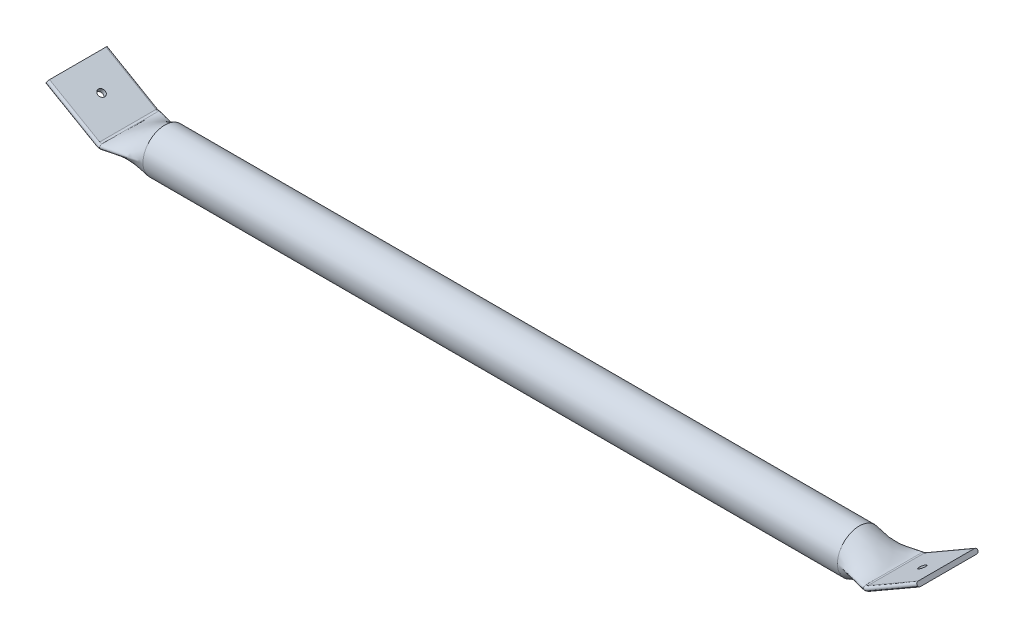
ISO-10303-21;
HEADER;
FILE_DESCRIPTION(('STEP AP214'),'2;1');
FILE_NAME('part.step','',(''),(''),'','','');
FILE_SCHEMA(('AUTOMOTIVE_DESIGN { 1 0 10303 214 1 1 1 1 }'));
ENDSEC;
DATA;
#1=APPLICATION_CONTEXT('core data for automotive mechanical design processes');
#2=APPLICATION_PROTOCOL_DEFINITION('international standard','automotive_design',2000,#1);
#3=PRODUCT_CONTEXT('',#1,'mechanical');
#4=PRODUCT('Part','Part','',(#3));
#5=PRODUCT_RELATED_PRODUCT_CATEGORY('part','',(#4));
#6=PRODUCT_DEFINITION_FORMATION('','',#4);
#7=PRODUCT_DEFINITION_CONTEXT('part definition',#1,'design');
#8=PRODUCT_DEFINITION('design','',#6,#7);
#9=PRODUCT_DEFINITION_SHAPE('','',#8);
#10=(LENGTH_UNIT() NAMED_UNIT(*) SI_UNIT(.MILLI.,.METRE.));
#11=(NAMED_UNIT(*) PLANE_ANGLE_UNIT() SI_UNIT($,.RADIAN.));
#12=(NAMED_UNIT(*) SI_UNIT($,.STERADIAN.) SOLID_ANGLE_UNIT());
#13=UNCERTAINTY_MEASURE_WITH_UNIT(LENGTH_MEASURE(1.E-05),#10,'distance_accuracy_value','');
#14=(GEOMETRIC_REPRESENTATION_CONTEXT(3) GLOBAL_UNCERTAINTY_ASSIGNED_CONTEXT((#13)) GLOBAL_UNIT_ASSIGNED_CONTEXT((#10,
#11,#12)) REPRESENTATION_CONTEXT('',''));
#15=CARTESIAN_POINT('',(0.,0.,0.));
#16=DIRECTION('',(0.,0.,1.));
#17=DIRECTION('',(1.,0.,0.));
#18=AXIS2_PLACEMENT_3D('',#15,#16,#17);
#19=CARTESIAN_POINT('',(380.999999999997,6.10622663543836E-12,5.32907051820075E-12));
#20=DIRECTION('',(-1.,0.,0.));
#21=DIRECTION('',(0.,0.,0.999999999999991));
#22=AXIS2_PLACEMENT_3D('',#19,#20,#21);
#23=CYLINDRICAL_SURFACE('',#22,23.9141);
#24=CARTESIAN_POINT('',(380.999999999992,1.86033255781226,-23.8416304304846));
#25=CARTESIAN_POINT('',(380.999999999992,2.25106655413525,-23.8111391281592));
#26=CARTESIAN_POINT('',(380.999999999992,2.64103487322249,-23.7709371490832));
#27=CARTESIAN_POINT('',(380.999999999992,3.41971649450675,-23.6712165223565));
#28=CARTESIAN_POINT('',(380.999999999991,3.80842222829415,-23.6116387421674));
#29=CARTESIAN_POINT('',(380.999999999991,4.58356146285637,-23.4732611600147));
#30=CARTESIAN_POINT('',(380.999999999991,4.96998506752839,-23.3944059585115));
#31=CARTESIAN_POINT('',(380.999999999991,5.73954745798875,-23.2175632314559));
#32=CARTESIAN_POINT('',(380.999999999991,6.12267429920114,-23.1195237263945));
#33=CARTESIAN_POINT('',(380.999999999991,6.88462941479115,-22.9044045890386));
#34=CARTESIAN_POINT('',(380.999999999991,7.26344379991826,-22.7872757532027));
#35=CARTESIAN_POINT('',(380.999999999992,8.01575866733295,-22.5340668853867));
#36=CARTESIAN_POINT('',(380.999999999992,8.38924319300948,-22.3979394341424));
#37=CARTESIAN_POINT('',(380.999999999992,9.12989002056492,-22.1068367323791));
#38=CARTESIAN_POINT('',(380.999999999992,9.49703390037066,-21.9518145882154));
#39=CARTESIAN_POINT('',(380.999999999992,10.2239605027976,-21.6229791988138));
#40=CARTESIAN_POINT('',(380.999999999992,10.583721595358,-21.4491181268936));
#41=CARTESIAN_POINT('',(380.999999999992,11.294913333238,-21.0829881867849));
#42=CARTESIAN_POINT('',(380.999999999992,11.6463203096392,-20.8906733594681));
#43=CARTESIAN_POINT('',(380.999999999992,12.3398732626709,-20.4881907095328));
#44=CARTESIAN_POINT('',(380.999999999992,12.6819952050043,-20.2779814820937));
#45=CARTESIAN_POINT('',(380.999999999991,13.3560270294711,-19.8402268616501));
#46=CARTESIAN_POINT('',(380.999999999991,13.6879129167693,-19.6126445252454));
#47=CARTESIAN_POINT('',(380.999999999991,14.3405266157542,-19.1406712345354));
#48=CARTESIAN_POINT('',(380.999999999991,14.6612306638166,-18.8962474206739));
#49=CARTESIAN_POINT('',(380.999999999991,15.290531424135,-18.3911146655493));
#50=CARTESIAN_POINT('',(380.999999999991,15.5991044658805,-18.1303762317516));
#51=CARTESIAN_POINT('',(380.999999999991,16.2032008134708,-17.593145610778));
#52=CARTESIAN_POINT('',(380.999999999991,16.4987000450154,-17.3166263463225));
#53=CARTESIAN_POINT('',(380.999999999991,17.0756828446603,-16.7483422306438));
#54=CARTESIAN_POINT('',(380.999999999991,17.3571409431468,-16.4565515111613));
#55=CARTESIAN_POINT('',(380.999999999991,17.9051506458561,-15.8583537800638));
#56=CARTESIAN_POINT('',(380.999999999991,18.1716752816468,-15.5519220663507));
#57=CARTESIAN_POINT('',(380.999999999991,18.6891840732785,-14.9253683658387));
#58=CARTESIAN_POINT('',(380.999999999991,18.9401421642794,-14.6052248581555));
#59=CARTESIAN_POINT('',(380.999999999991,19.4258388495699,-13.9521333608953));
#60=CARTESIAN_POINT('',(380.999999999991,19.6605531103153,-13.6191672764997));
#61=CARTESIAN_POINT('',(380.999999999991,20.1130930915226,-12.941327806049));
#62=CARTESIAN_POINT('',(380.999999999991,20.3308965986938,-12.5964395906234));
#63=CARTESIAN_POINT('',(380.999999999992,20.7489432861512,-11.8956502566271));
#64=CARTESIAN_POINT('',(380.999999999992,20.9491663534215,-11.5397371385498));
#65=CARTESIAN_POINT('',(380.999999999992,21.3313790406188,-10.8177932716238));
#66=CARTESIAN_POINT('',(380.999999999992,21.5133501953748,-10.4517527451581));
#67=CARTESIAN_POINT('',(380.999999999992,21.8583941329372,-9.71045118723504));
#68=CARTESIAN_POINT('',(380.999999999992,22.0214491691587,-9.33518189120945));
#69=CARTESIAN_POINT('',(380.999999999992,22.327964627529,-8.57632159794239));
#70=CARTESIAN_POINT('',(380.999999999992,22.4714068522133,-8.19272324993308));
#71=CARTESIAN_POINT('',(380.999999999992,22.7384234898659,-7.41830782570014));
#72=CARTESIAN_POINT('',(380.999999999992,22.8619806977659,-7.02748482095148));
#73=CARTESIAN_POINT('',(380.999999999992,23.0889904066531,-6.23973764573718));
#74=CARTESIAN_POINT('',(380.999999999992,23.1924282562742,-5.84280925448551));
#75=CARTESIAN_POINT('',(380.999999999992,23.3789498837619,-5.04396647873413));
#76=CARTESIAN_POINT('',(380.999999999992,23.4620222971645,-4.64204944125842));
#77=CARTESIAN_POINT('',(380.999999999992,23.6075671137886,-3.83434535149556));
#78=CARTESIAN_POINT('',(380.999999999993,23.6700317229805,-3.42855689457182));
#79=CARTESIAN_POINT('',(380.999999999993,23.7741092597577,-2.6142262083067));
#80=CARTESIAN_POINT('',(380.999999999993,23.8157177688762,-2.20568341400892));
#81=CARTESIAN_POINT('',(380.999999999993,23.8778492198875,-1.38696045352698));
#82=CARTESIAN_POINT('',(380.999999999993,23.8983704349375,-0.976780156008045));
#83=CARTESIAN_POINT('',(380.999999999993,23.9180291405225,-0.155900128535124));
#84=CARTESIAN_POINT('',(380.999999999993,23.9171663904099,0.254799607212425));
#85=CARTESIAN_POINT('',(380.999999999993,23.8940798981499,1.07558929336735));
#86=CARTESIAN_POINT('',(380.999999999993,23.8718564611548,1.48567925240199));
#87=CARTESIAN_POINT('',(380.999999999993,23.8063391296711,2.30413198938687));
#88=CARTESIAN_POINT('',(380.999999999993,23.7630471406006,2.7124949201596));
#89=CARTESIAN_POINT('',(380.999999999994,23.6556222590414,3.52637608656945));
#90=CARTESIAN_POINT('',(380.999999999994,23.5914940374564,3.93189493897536));
#91=CARTESIAN_POINT('',(380.999999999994,23.4426413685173,4.73897010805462));
#92=CARTESIAN_POINT('',(380.999999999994,23.3579250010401,5.14052791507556));
#93=CARTESIAN_POINT('',(380.999999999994,23.1681343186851,5.93856223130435));
#94=CARTESIAN_POINT('',(380.999999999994,23.0630716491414,6.33504150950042));
#95=CARTESIAN_POINT('',(380.999999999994,22.8328332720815,7.1218013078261));
#96=CARTESIAN_POINT('',(380.999999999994,22.7076724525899,7.51208618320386));
#97=CARTESIAN_POINT('',(380.999999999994,22.4374616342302,8.28533295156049));
#98=CARTESIAN_POINT('',(380.999999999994,22.2924290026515,8.66830090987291));
#99=CARTESIAN_POINT('',(380.999999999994,21.982777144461,9.42582186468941));
#100=CARTESIAN_POINT('',(380.999999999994,21.8181760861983,9.80038228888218));
#101=CARTESIAN_POINT('',(380.999999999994,21.4700966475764,10.540195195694));
#102=CARTESIAN_POINT('',(380.999999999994,21.2866360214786,10.9054560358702));
#103=CARTESIAN_POINT('',(380.999999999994,20.9014973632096,11.625767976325));
#104=CARTESIAN_POINT('',(380.999999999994,20.6998379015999,11.9808290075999));
#105=CARTESIAN_POINT('',(380.999999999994,20.2789722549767,12.6798419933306));
#106=CARTESIAN_POINT('',(380.999999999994,20.059786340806,13.0238061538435));
#107=CARTESIAN_POINT('',(380.999999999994,19.6045349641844,13.6997250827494));
#108=CARTESIAN_POINT('',(380.999999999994,19.3684918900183,14.0316949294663));
#109=CARTESIAN_POINT('',(380.999999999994,18.8801914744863,14.6827218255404));
#110=CARTESIAN_POINT('',(380.999999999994,18.6279586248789,15.0017972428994));
#111=CARTESIAN_POINT('',(380.999999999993,18.1079526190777,15.6261414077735));
#112=CARTESIAN_POINT('',(380.999999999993,17.8402056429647,15.9314319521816));
#113=CARTESIAN_POINT('',(380.999999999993,17.28980846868,16.5272795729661));
#114=CARTESIAN_POINT('',(380.999999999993,17.0071852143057,16.8178615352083));
#115=CARTESIAN_POINT('',(380.999999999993,16.4279534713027,17.3836899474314));
#116=CARTESIAN_POINT('',(380.999999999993,16.1313702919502,17.6589623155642));
#117=CARTESIAN_POINT('',(380.999999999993,15.5251809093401,18.1936553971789));
#118=CARTESIAN_POINT('',(380.999999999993,15.2155987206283,18.4531033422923));
#119=CARTESIAN_POINT('',(380.999999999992,14.5843561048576,18.9556127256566));
#120=CARTESIAN_POINT('',(380.999999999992,14.2627193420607,19.1987038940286));
#121=CARTESIAN_POINT('',(380.999999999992,13.6083161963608,19.6679691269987));
#122=CARTESIAN_POINT('',(380.999999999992,13.2755735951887,19.8941763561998));
#123=CARTESIAN_POINT('',(380.999999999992,12.5999042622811,20.3291376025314));
#124=CARTESIAN_POINT('',(380.999999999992,12.2570015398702,20.5379289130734));
#125=CARTESIAN_POINT('',(380.999999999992,11.5619635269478,20.9375340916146));
#126=CARTESIAN_POINT('',(380.999999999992,11.2098522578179,21.1283897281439));
#127=CARTESIAN_POINT('',(380.999999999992,10.4973254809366,21.4915540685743));
#128=CARTESIAN_POINT('',(380.999999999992,10.1369335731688,21.6639090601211));
#129=CARTESIAN_POINT('',(380.999999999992,9.40882963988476,21.9897242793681));
#130=CARTESIAN_POINT('',(380.999999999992,9.04113898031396,22.1432322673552));
#131=CARTESIAN_POINT('',(380.999999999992,8.29948012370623,22.4312989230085));
#132=CARTESIAN_POINT('',(380.999999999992,7.92553012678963,22.5659044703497));
#133=CARTESIAN_POINT('',(380.999999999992,7.17236652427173,22.8160627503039));
#134=CARTESIAN_POINT('',(380.999999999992,6.79316869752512,22.9316630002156));
#135=CARTESIAN_POINT('',(380.999999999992,6.03052692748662,23.1437142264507));
#136=CARTESIAN_POINT('',(380.999999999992,5.64709672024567,23.2402146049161));
#137=CARTESIAN_POINT('',(380.999999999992,4.87701479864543,23.4139824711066));
#138=CARTESIAN_POINT('',(380.999999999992,4.49037485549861,23.491302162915));
#139=CARTESIAN_POINT('',(380.999999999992,3.71486424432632,23.6265592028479));
#140=CARTESIAN_POINT('',(380.999999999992,3.32600335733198,23.6845523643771));
#141=CARTESIAN_POINT('',(380.999999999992,2.74140757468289,23.7571343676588));
#142=CARTESIAN_POINT('',(380.999999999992,2.54654241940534,23.7789108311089));
#143=CARTESIAN_POINT('',(380.999999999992,2.1574620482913,23.8172989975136));
#144=CARTESIAN_POINT('',(380.999999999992,1.96324974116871,23.8339402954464));
#145=CARTESIAN_POINT('',(380.999999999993,1.61127384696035,23.860552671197));
#146=CARTESIAN_POINT('',(380.999999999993,1.45356114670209,23.8711899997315));
#147=CARTESIAN_POINT('',(380.999999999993,1.17516547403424,23.8861238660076));
#148=CARTESIAN_POINT('',(380.999999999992,1.05453191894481,23.8913245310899));
#149=CARTESIAN_POINT('',(380.999999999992,0.826031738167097,23.8995575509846));
#150=CARTESIAN_POINT('',(380.999999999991,0.718170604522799,23.9027615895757));
#151=CARTESIAN_POINT('',(380.999999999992,0.504298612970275,23.9083500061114));
#152=CARTESIAN_POINT('',(380.999999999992,0.398288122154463,23.9107476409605));
#153=CARTESIAN_POINT('',(380.999999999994,0.186980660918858,23.9139705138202));
#154=CARTESIAN_POINT('',(380.999999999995,0.0816838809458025,23.914806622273));
#155=CARTESIAN_POINT('',(380.999999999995,-0.129078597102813,23.9145833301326));
#156=CARTESIAN_POINT('',(380.999999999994,-0.234544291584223,23.9135208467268));
#157=CARTESIAN_POINT('',(380.999999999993,-0.446482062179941,23.909915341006));
#158=CARTESIAN_POINT('',(380.999999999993,-0.552953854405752,23.9073578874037));
#159=CARTESIAN_POINT('',(380.999999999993,-0.768392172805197,23.9014830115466));
#160=CARTESIAN_POINT('',(380.999999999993,-0.877358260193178,23.8981490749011));
#161=CARTESIAN_POINT('',(380.999999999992,-1.11152205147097,23.8891393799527));
#162=CARTESIAN_POINT('',(380.999999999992,-1.23670988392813,23.8831879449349));
#163=CARTESIAN_POINT('',(380.999999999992,-1.5281180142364,23.8664800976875));
#164=CARTESIAN_POINT('',(380.999999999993,-1.69428318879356,23.8547869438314));
#165=CARTESIAN_POINT('',(380.999999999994,-2.05552703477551,23.8261646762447));
#166=CARTESIAN_POINT('',(380.999999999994,-2.25056148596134,23.8086767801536));
#167=CARTESIAN_POINT('',(380.999999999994,-2.64042261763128,23.7686426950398));
#168=CARTESIAN_POINT('',(380.999999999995,-2.83524848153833,23.746088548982));
#169=CARTESIAN_POINT('',(380.999999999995,-3.41969420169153,23.6711731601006));
#170=CARTESIAN_POINT('',(380.999999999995,-3.8084162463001,23.6116271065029));
#171=CARTESIAN_POINT('',(380.999999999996,-4.58356746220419,23.4732728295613));
#172=CARTESIAN_POINT('',(380.999999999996,-4.96998667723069,23.3944090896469));
#173=CARTESIAN_POINT('',(380.999999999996,-5.73954584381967,23.2175600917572));
#174=CARTESIAN_POINT('',(380.999999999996,-6.12267386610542,23.1195228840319));
#175=CARTESIAN_POINT('',(380.999999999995,-6.88462984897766,22.9044054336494));
#176=CARTESIAN_POINT('',(380.999999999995,-7.26344391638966,22.7872759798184));
#177=CARTESIAN_POINT('',(380.999999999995,-8.01575855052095,22.5340666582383));
#178=CARTESIAN_POINT('',(380.999999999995,-8.38924316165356,22.3979393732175));
#179=CARTESIAN_POINT('',(380.999999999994,-9.12989005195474,22.1068367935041));
#180=CARTESIAN_POINT('',(380.999999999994,-9.49703390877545,21.9518146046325));
#181=CARTESIAN_POINT('',(380.999999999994,-10.2239604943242,21.6229791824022));
#182=CARTESIAN_POINT('',(380.999999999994,-10.5837215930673,21.4491181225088));
#183=CARTESIAN_POINT('',(380.999999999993,-11.2949133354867,21.0829881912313));
#184=CARTESIAN_POINT('',(380.999999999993,-11.6463203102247,20.8906733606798));
#185=CARTESIAN_POINT('',(380.999999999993,-12.3398732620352,20.4881907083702));
#186=CARTESIAN_POINT('',(380.999999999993,-12.6819952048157,20.2779814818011));
#187=CARTESIAN_POINT('',(380.999999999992,-13.3560270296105,19.8402268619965));
#188=CARTESIAN_POINT('',(380.999999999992,-13.6879129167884,19.612644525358));
#189=CARTESIAN_POINT('',(380.999999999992,-14.3405266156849,19.1406712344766));
#190=CARTESIAN_POINT('',(380.999999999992,-14.6612306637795,18.8962474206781));
#191=CARTESIAN_POINT('',(380.999999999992,-15.2905314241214,18.3911146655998));
#192=CARTESIAN_POINT('',(380.999999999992,-15.5991044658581,18.1303762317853));
#193=CARTESIAN_POINT('',(380.999999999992,-16.203200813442,17.5931456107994));
#194=CARTESIAN_POINT('',(380.999999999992,-16.4987000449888,17.3166263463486));
#195=CARTESIAN_POINT('',(380.999999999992,-17.0756828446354,16.7483422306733));
#196=CARTESIAN_POINT('',(380.999999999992,-17.3571409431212,16.4565515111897));
#197=CARTESIAN_POINT('',(380.999999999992,-17.90515064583,15.8583537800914));
#198=CARTESIAN_POINT('',(380.999999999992,-18.1716752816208,15.5519220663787));
#199=CARTESIAN_POINT('',(380.999999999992,-18.6891840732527,14.925368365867));
#200=CARTESIAN_POINT('',(380.999999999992,-18.9401421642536,14.6052248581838));
#201=CARTESIAN_POINT('',(380.999999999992,-19.425838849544,13.9521333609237));
#202=CARTESIAN_POINT('',(380.999999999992,-19.6605531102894,13.6191672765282));
#203=CARTESIAN_POINT('',(380.999999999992,-20.1130930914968,12.9413278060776));
#204=CARTESIAN_POINT('',(380.999999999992,-20.330896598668,12.596439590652));
#205=CARTESIAN_POINT('',(380.999999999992,-20.7489432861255,11.8956502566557));
#206=CARTESIAN_POINT('',(380.999999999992,-20.9491663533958,11.5397371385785));
#207=CARTESIAN_POINT('',(380.999999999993,-21.3313790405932,10.8177932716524));
#208=CARTESIAN_POINT('',(380.999999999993,-21.5133501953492,10.4517527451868));
#209=CARTESIAN_POINT('',(380.999999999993,-21.8583941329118,9.71045118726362));
#210=CARTESIAN_POINT('',(380.999999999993,-22.0214491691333,9.33518189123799));
#211=CARTESIAN_POINT('',(380.999999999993,-22.3279646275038,8.57632159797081));
#212=CARTESIAN_POINT('',(380.999999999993,-22.4714068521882,8.19272324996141));
#213=CARTESIAN_POINT('',(380.999999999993,-22.7384234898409,7.41830782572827));
#214=CARTESIAN_POINT('',(380.999999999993,-22.8619806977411,7.0274848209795));
#215=CARTESIAN_POINT('',(380.999999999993,-23.0889904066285,6.23973764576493));
#216=CARTESIAN_POINT('',(380.999999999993,-23.1924282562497,5.8428092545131));
#217=CARTESIAN_POINT('',(380.999999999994,-23.3789498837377,5.04396647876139));
#218=CARTESIAN_POINT('',(380.999999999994,-23.4620222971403,4.64204944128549));
#219=CARTESIAN_POINT('',(380.999999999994,-23.6075671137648,3.83434535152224));
#220=CARTESIAN_POINT('',(380.999999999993,-23.6700317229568,3.42855689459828));
#221=CARTESIAN_POINT('',(380.999999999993,-23.7741092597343,2.61422620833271));
#222=CARTESIAN_POINT('',(380.999999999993,-23.815717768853,2.20568341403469));
#223=CARTESIAN_POINT('',(380.999999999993,-23.8778492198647,1.38696045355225));
#224=CARTESIAN_POINT('',(380.999999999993,-23.8983704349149,0.976780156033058));
#225=CARTESIAN_POINT('',(380.999999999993,-23.9180291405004,0.155900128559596));
#226=CARTESIAN_POINT('',(380.999999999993,-23.917166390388,-0.254799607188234));
#227=CARTESIAN_POINT('',(380.999999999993,-23.8940798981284,-1.07558929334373));
#228=CARTESIAN_POINT('',(380.999999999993,-23.8718564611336,-1.48567925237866));
#229=CARTESIAN_POINT('',(380.999999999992,-23.8063391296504,-2.30413198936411));
#230=CARTESIAN_POINT('',(380.999999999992,-23.7630471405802,-2.71249492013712));
#231=CARTESIAN_POINT('',(380.999999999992,-23.6556222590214,-3.52637608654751));
#232=CARTESIAN_POINT('',(380.999999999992,-23.5914940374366,-3.93189493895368));
#233=CARTESIAN_POINT('',(380.999999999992,-23.4426413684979,-4.7389701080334));
#234=CARTESIAN_POINT('',(380.999999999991,-23.3579250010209,-5.14052791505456));
#235=CARTESIAN_POINT('',(380.999999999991,-23.1681343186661,-5.9385622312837));
#236=CARTESIAN_POINT('',(380.999999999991,-23.0630716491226,-6.33504150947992));
#237=CARTESIAN_POINT('',(380.999999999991,-22.8328332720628,-7.1218013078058));
#238=CARTESIAN_POINT('',(380.999999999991,-22.7076724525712,-7.51208618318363));
#239=CARTESIAN_POINT('',(380.99999999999,-22.4374616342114,-8.28533295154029));
#240=CARTESIAN_POINT('',(380.99999999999,-22.2924290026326,-8.66830090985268));
#241=CARTESIAN_POINT('',(380.99999999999,-21.9827771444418,-9.42582186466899));
#242=CARTESIAN_POINT('',(380.99999999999,-21.8181760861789,-9.80038228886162));
#243=CARTESIAN_POINT('',(380.99999999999,-21.4700966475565,-10.5401951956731));
#244=CARTESIAN_POINT('',(380.99999999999,-21.2866360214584,-10.905456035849));
#245=CARTESIAN_POINT('',(380.999999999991,-20.9014973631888,-11.6257679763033));
#246=CARTESIAN_POINT('',(380.999999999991,-20.6998379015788,-11.9808290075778));
#247=CARTESIAN_POINT('',(380.999999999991,-20.2789722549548,-12.6798419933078));
#248=CARTESIAN_POINT('',(380.999999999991,-20.0597863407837,-13.0238061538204));
#249=CARTESIAN_POINT('',(380.999999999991,-19.6045349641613,-13.6997250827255));
#250=CARTESIAN_POINT('',(380.999999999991,-19.3684918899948,-14.031694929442));
#251=CARTESIAN_POINT('',(380.999999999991,-18.8801914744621,-14.6827218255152));
#252=CARTESIAN_POINT('',(380.999999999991,-18.6279586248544,-15.0017972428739));
#253=CARTESIAN_POINT('',(380.999999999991,-18.1079526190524,-15.6261414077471));
#254=CARTESIAN_POINT('',(380.999999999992,-17.8402056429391,-15.9314319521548));
#255=CARTESIAN_POINT('',(380.999999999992,-17.2898084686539,-16.5272795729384));
#256=CARTESIAN_POINT('',(380.999999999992,-17.0071852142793,-16.8178615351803));
#257=CARTESIAN_POINT('',(380.999999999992,-16.427953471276,-17.3836899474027));
#258=CARTESIAN_POINT('',(380.999999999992,-16.1313702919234,-17.6589623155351));
#259=CARTESIAN_POINT('',(380.999999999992,-15.525180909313,-18.1936553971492));
#260=CARTESIAN_POINT('',(380.999999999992,-15.2155987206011,-18.4531033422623));
#261=CARTESIAN_POINT('',(380.999999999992,-14.5843561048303,-18.9556127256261));
#262=CARTESIAN_POINT('',(380.999999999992,-14.2627193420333,-19.1987038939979));
#263=CARTESIAN_POINT('',(380.999999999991,-13.6083161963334,-19.6679691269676));
#264=CARTESIAN_POINT('',(380.999999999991,-13.2755735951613,-19.8941763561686));
#265=CARTESIAN_POINT('',(380.999999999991,-12.5999042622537,-20.3291376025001));
#266=CARTESIAN_POINT('',(380.999999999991,-12.2570015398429,-20.537928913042));
#267=CARTESIAN_POINT('',(380.999999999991,-11.5619635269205,-20.9375340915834));
#268=CARTESIAN_POINT('',(380.999999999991,-11.2098522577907,-21.1283897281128));
#269=CARTESIAN_POINT('',(380.999999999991,-10.4973254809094,-21.4915540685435));
#270=CARTESIAN_POINT('',(380.999999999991,-10.1369335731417,-21.6639090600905));
#271=CARTESIAN_POINT('',(380.999999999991,-9.40882963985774,-21.9897242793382));
#272=CARTESIAN_POINT('',(380.999999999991,-9.04113898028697,-22.1432322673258));
#273=CARTESIAN_POINT('',(380.999999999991,-8.29948012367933,-22.4312989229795));
#274=CARTESIAN_POINT('',(380.999999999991,-7.92553012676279,-22.5659044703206));
#275=CARTESIAN_POINT('',(380.999999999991,-7.17236652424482,-22.8160627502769));
#276=CARTESIAN_POINT('',(380.999999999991,-6.7931686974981,-22.9316630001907));
#277=CARTESIAN_POINT('',(380.999999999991,-6.0305269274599,-23.1437142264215));
#278=CARTESIAN_POINT('',(380.999999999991,-5.64709672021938,-23.2402146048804));
#279=CARTESIAN_POINT('',(380.999999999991,-4.87701479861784,-23.4139824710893));
#280=CARTESIAN_POINT('',(380.999999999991,-4.49037485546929,-23.4913021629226));
#281=CARTESIAN_POINT('',(380.999999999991,-3.7148642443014,-23.6265592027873));
#282=CARTESIAN_POINT('',(380.99999999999,-3.32600335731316,-23.6845523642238));
#283=CARTESIAN_POINT('',(380.99999999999,-2.74140757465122,-23.757134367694));
#284=CARTESIAN_POINT('',(380.99999999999,-2.54654241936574,-23.7789108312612));
#285=CARTESIAN_POINT('',(380.99999999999,-2.15746204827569,-23.8172989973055));
#286=CARTESIAN_POINT('',(380.999999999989,-1.96324974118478,-23.8339402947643));
#287=CARTESIAN_POINT('',(380.99999999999,-1.61127384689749,-23.8605526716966));
#288=CARTESIAN_POINT('',(380.99999999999,-1.45356114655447,-23.8711900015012));
#289=CARTESIAN_POINT('',(380.999999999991,-1.17516547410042,-23.8861238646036));
#290=CARTESIAN_POINT('',(380.999999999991,-1.05453191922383,-23.8913245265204));
#291=CARTESIAN_POINT('',(380.999999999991,-0.82603173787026,-23.8995575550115));
#292=CARTESIAN_POINT('',(380.999999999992,-0.718170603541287,-23.902761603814));
#293=CARTESIAN_POINT('',(380.999999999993,-0.50429861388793,-23.9083499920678));
#294=CARTESIAN_POINT('',(380.999999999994,-0.398288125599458,-23.9107475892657));
#295=CARTESIAN_POINT('',(380.999999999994,-0.186980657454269,-23.9139705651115));
#296=CARTESIAN_POINT('',(380.999999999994,-0.0816838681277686,-23.9148068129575));
#297=CARTESIAN_POINT('',(380.999999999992,0.129078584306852,-23.9145831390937));
#298=CARTESIAN_POINT('',(380.999999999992,0.234544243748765,-23.9135201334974));
#299=CARTESIAN_POINT('',(380.999999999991,0.446482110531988,-23.9099160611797));
#300=CARTESIAN_POINT('',(380.999999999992,0.552954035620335,-23.9073605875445));
#301=CARTESIAN_POINT('',(380.999999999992,0.768391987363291,-23.9014802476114));
#302=CARTESIAN_POINT('',(380.999999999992,0.877357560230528,-23.898138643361));
#303=CARTESIAN_POINT('',(380.999999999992,1.11152285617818,-23.8891513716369));
#304=CARTESIAN_POINT('',(380.999999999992,1.23671309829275,-23.8832358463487));
#305=CARTESIAN_POINT('',(380.999999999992,1.43824072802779,-23.8716038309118));
#306=CARTESIAN_POINT('',(380.999999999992,1.51462672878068,-23.8667060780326));
#307=CARTESIAN_POINT('',(380.999999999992,1.68080090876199,-23.8552688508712));
#308=CARTESIAN_POINT('',(380.999999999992,1.77057977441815,-23.8485921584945));
#309=CARTESIAN_POINT('',(380.999999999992,1.86033255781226,-23.8416304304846));
#310=B_SPLINE_CURVE_WITH_KNOTS('',3,(#24,#25,#26,#27,#28,#29,#30,#31,#32,#33,#34,#35,#36,#37,
#38,#39,#40,#41,#42,#43,#44,#45,#46,#47,#48,#49,#50,#51,#52,#53,#54,#55,#56,#57,#58,#59,#60,#61,
#62,#63,#64,#65,#66,#67,#68,#69,#70,#71,#72,#73,#74,#75,#76,#77,#78,#79,#80,#81,#82,#83,#84,#85,
#86,#87,#88,#89,#90,#91,#92,#93,#94,#95,#96,#97,#98,#99,#100,#101,#102,#103,#104,#105,#106,#107,
#108,#109,#110,#111,#112,#113,#114,#115,#116,#117,#118,#119,#120,#121,#122,#123,#124,#125,#126,
#127,#128,#129,#130,#131,#132,#133,#134,#135,#136,#137,#138,#139,#140,#141,#142,#143,#144,#145,
#146,#147,#148,#149,#150,#151,#152,#153,#154,#155,#156,#157,#158,#159,#160,#161,#162,#163,#164,
#165,#166,#167,#168,#169,#170,#171,#172,#173,#174,#175,#176,#177,#178,#179,#180,#181,#182,#183,
#184,#185,#186,#187,#188,#189,#190,#191,#192,#193,#194,#195,#196,#197,#198,#199,#200,#201,#202,
#203,#204,#205,#206,#207,#208,#209,#210,#211,#212,#213,#214,#215,#216,#217,#218,#219,#220,#221,
#222,#223,#224,#225,#226,#227,#228,#229,#230,#231,#232,#233,#234,#235,#236,#237,#238,#239,#240,
#241,#242,#243,#244,#245,#246,#247,#248,#249,#250,#251,#252,#253,#254,#255,#256,#257,#258,#259,
#260,#261,#262,#263,#264,#265,#266,#267,#268,#269,#270,#271,#272,#273,#274,#275,#276,#277,#278,
#279,#280,#281,#282,#283,#284,#285,#286,#287,#288,#289,#290,#291,#292,#293,#294,#295,#296,#297,
#298,#299,#300,#301,#302,#303,#304,#305,#306,#307,#308,#309),.UNSPECIFIED.,.F.,.F.,(4,2,2,2,2,2,
2,2,2,2,2,2,2,2,2,2,2,2,2,2,2,2,2,2,2,2,2,2,2,2,2,2,2,2,2,2,2,2,2,2,2,2,2,2,2,2,2,2,2,2,2,2,2,2,
2,2,2,2,2,2,2,2,2,2,2,2,2,2,2,2,2,2,2,2,2,2,2,2,2,2,2,2,2,2,2,2,2,2,2,2,2,2,2,2,2,2,2,2,2,2,2,2,
2,2,2,2,2,2,2,2,2,2,2,2,2,2,2,2,2,2,2,2,2,2,2,2,2,2,2,2,2,2,2,2,2,2,2,2,2,2,2,2,4),(0.,
1.17563369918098,2.35488949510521,3.53757492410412,4.72351033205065,5.91255233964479,
7.10461703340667,8.29970290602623,9.49789718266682,10.6991570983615,11.9032762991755,
13.1100314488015,14.3192116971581,15.5306447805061,16.7442229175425,17.9599278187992,
19.1777617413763,20.3975826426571,21.6191929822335,22.8423817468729,24.0669521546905,
25.2927492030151,26.5196871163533,27.7477558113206,28.9768814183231,30.2068987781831,
31.4376009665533,32.6687680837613,33.9001959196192,35.1317245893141,36.3632671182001,
37.5947920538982,38.826205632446,40.0573433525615,41.2879986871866,42.517951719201,
43.7469978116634,44.9749765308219,46.201823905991,47.4275267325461,48.6519926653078,
49.8750623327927,51.0965367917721,52.3162050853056,53.5338719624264,54.7494046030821,
55.9628125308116,57.1740697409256,58.3830623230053,59.5896139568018,60.7935118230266,
61.9945327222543,63.1924750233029,64.3873160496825,65.5791393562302,66.7679359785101,
67.9536163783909,69.1360334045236,70.3150055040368,70.9031842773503,71.4879070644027,
71.9620818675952,72.3242948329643,72.6480187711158,72.9661259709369,73.2820103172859,
73.598408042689,73.9179116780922,74.2449573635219,74.6209179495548,75.1206090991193,
75.7080064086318,76.2963328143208,77.4755886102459,78.658274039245,79.8442094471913,
81.0332514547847,82.2253161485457,83.4204020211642,84.6185962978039,85.8198562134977,
87.0239754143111,88.2307305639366,89.4399108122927,90.6513438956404,91.8649220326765,
93.080626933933,94.29846085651,95.5182817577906,96.7398920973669,97.9630808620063,
99.1876512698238,100.413448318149,101.640386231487,102.868454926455,104.097580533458,
105.327597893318,106.558300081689,107.789467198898,109.020895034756,110.252423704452,
111.483966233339,112.715491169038,113.946904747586,115.178042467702,116.408697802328,
117.638650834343,118.867696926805,120.095675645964,121.322523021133,122.548225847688,
123.772691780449,124.995761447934,126.217235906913,127.436904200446,128.654571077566,
129.870103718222,131.083511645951,132.294768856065,133.503761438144,134.71031307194,
135.914210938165,137.115231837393,138.313174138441,139.508015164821,140.699838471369,
141.88863509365,143.074315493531,144.256732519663,145.435704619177,146.02388339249,
146.608606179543,147.082780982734,147.444993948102,147.768717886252,148.086825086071,
148.402709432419,148.719107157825,149.03861079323,149.36565647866,149.741617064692,
149.971242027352,150.241314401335),.UNSPECIFIED.);
#311=CARTESIAN_POINT('',(380.999999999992,1.86033255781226,-23.8416304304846));
#312=VERTEX_POINT('',#311);
#313=EDGE_CURVE('E15',#312,#312,#310,.T.);
#314=ORIENTED_EDGE('',*,*,#313,.F.);
#315=EDGE_LOOP('',(#314));
#316=FACE_BOUND('',#315,.T.);
#317=CARTESIAN_POINT('',(-381.000000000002,4.44089209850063E-12,1.11022302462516E-12));
#318=DIRECTION('',(1.,0.,0.));
#319=DIRECTION('',(0.,0.,-0.999999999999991));
#320=AXIS2_PLACEMENT_3D('',#317,#318,#319);
#321=CIRCLE('',#320,23.9141);
#322=CARTESIAN_POINT('',(-381.000000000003,4.5988645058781E-12,-23.9140999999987));
#323=VERTEX_POINT('',#322);
#324=EDGE_CURVE('E501',#323,#323,#321,.T.);
#325=ORIENTED_EDGE('',*,*,#324,.T.);
#326=EDGE_LOOP('',(#325));
#327=FACE_BOUND('',#326,.T.);
#328=ADVANCED_FACE('F243',(#316,#327),#23,.T.);
#329=CARTESIAN_POINT('',(380.999999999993,1.86033255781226,-23.8416304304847));
#330=CARTESIAN_POINT('',(419.099999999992,2.41300000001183,-30.9244999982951));
#331=CARTESIAN_POINT('',(380.999999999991,4.73346221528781,-23.6174437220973));
#332=CARTESIAN_POINT('',(419.099999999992,2.41300000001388,-28.261234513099));
#333=CARTESIAN_POINT('',(380.999999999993,10.4663229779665,-22.1129464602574));
#334=CARTESIAN_POINT('',(419.099999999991,2.41300000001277,-23.0024656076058));
#335=CARTESIAN_POINT('',(380.99999999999,17.8065602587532,-16.801613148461));
#336=CARTESIAN_POINT('',(419.099999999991,2.41300000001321,-15.260588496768));
#337=CARTESIAN_POINT('',(380.999999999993,22.7511312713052,-9.07129661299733));
#338=CARTESIAN_POINT('',(419.099999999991,2.4130000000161,-7.60797767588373));
#339=CARTESIAN_POINT('',(380.999999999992,24.496925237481,1.24344978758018E-11));
#340=CARTESIAN_POINT('',(419.099999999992,2.41300000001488,1.28785870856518E-11));
#341=CARTESIAN_POINT('',(380.999999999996,22.7511312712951,9.07129661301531));
#342=CARTESIAN_POINT('',(419.099999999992,2.41300000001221,7.60797767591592));
#343=CARTESIAN_POINT('',(380.999999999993,17.806560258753,16.8016131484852));
#344=CARTESIAN_POINT('',(419.099999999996,2.41300000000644,15.2605884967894));
#345=CARTESIAN_POINT('',(380.999999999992,10.4663229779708,22.1129464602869));
#346=CARTESIAN_POINT('',(419.099999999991,2.41300000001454,23.0024656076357));
#347=CARTESIAN_POINT('',(380.999999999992,4.73346221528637,23.6174437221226));
#348=CARTESIAN_POINT('',(419.099999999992,2.41300000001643,28.2612345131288));
#349=CARTESIAN_POINT('',(380.999999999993,1.61260010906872,23.8609606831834));
#350=CARTESIAN_POINT('',(419.099999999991,2.4130000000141,31.1541371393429));
#351=CARTESIAN_POINT('',(380.999999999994,1.22436253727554,23.8857331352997));
#352=CARTESIAN_POINT('',(419.099999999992,2.34828130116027,31.6491505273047));
#353=CARTESIAN_POINT('',(380.999999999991,0.808131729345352,23.900334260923));
#354=CARTESIAN_POINT('',(419.099999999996,1.95500775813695,32.4425035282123));
#355=CARTESIAN_POINT('',(380.999999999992,0.402470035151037,23.9114844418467));
#356=CARTESIAN_POINT('',(419.099999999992,1.16298646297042,33.1378144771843));
#357=CARTESIAN_POINT('',(380.999999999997,0.00182327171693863,23.9162567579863));
#358=CARTESIAN_POINT('',(419.099999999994,1.47659662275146E-11,33.4386813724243));
#359=CARTESIAN_POINT('',(380.999999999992,-0.399362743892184,23.9117242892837));
#360=CARTESIAN_POINT('',(419.099999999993,-1.16298646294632,33.1378144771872));
#361=CARTESIAN_POINT('',(380.999999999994,-0.806213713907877,23.9006640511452));
#362=CARTESIAN_POINT('',(419.099999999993,-1.95500775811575,32.4425035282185));
#363=CARTESIAN_POINT('',(380.999999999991,-1.22385534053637,23.8858530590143));
#364=CARTESIAN_POINT('',(419.099999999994,-2.34828130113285,31.6491505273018));
#365=CARTESIAN_POINT('',(380.999999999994,-1.61260010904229,23.860960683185));
#366=CARTESIAN_POINT('',(419.099999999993,-2.4129999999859,31.1541371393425));
#367=CARTESIAN_POINT('',(380.999999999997,-4.73346221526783,23.6174437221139));
#368=CARTESIAN_POINT('',(419.099999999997,-2.41299999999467,28.2612345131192));
#369=CARTESIAN_POINT('',(380.999999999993,-10.4663229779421,22.1129464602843));
#370=CARTESIAN_POINT('',(419.099999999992,-2.41299999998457,23.0024656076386));
#371=CARTESIAN_POINT('',(380.999999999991,-17.806560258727,16.8016131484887));
#372=CARTESIAN_POINT('',(419.099999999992,-2.41299999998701,15.2605884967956));
#373=CARTESIAN_POINT('',(380.999999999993,-22.7511312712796,9.07129661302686));
#374=CARTESIAN_POINT('',(419.099999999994,-2.41299999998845,7.60797767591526));
#375=CARTESIAN_POINT('',(380.999999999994,-24.4969252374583,1.24344978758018E-11));
#376=CARTESIAN_POINT('',(419.099999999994,-2.41299999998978,1.08801856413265E-11));
#377=CARTESIAN_POINT('',(380.999999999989,-22.7511312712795,-9.07129661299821));
#378=CARTESIAN_POINT('',(419.099999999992,-2.41299999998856,-7.60797767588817));
#379=CARTESIAN_POINT('',(380.999999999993,-17.8065602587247,-16.801613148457));
#380=CARTESIAN_POINT('',(419.09999999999,-2.41299999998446,-15.2605884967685));
#381=CARTESIAN_POINT('',(380.999999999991,-10.4663229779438,-22.1129464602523));
#382=CARTESIAN_POINT('',(419.099999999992,-2.41299999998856,-23.0024656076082));
#383=CARTESIAN_POINT('',(380.999999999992,-4.73346221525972,-23.6174437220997));
#384=CARTESIAN_POINT('',(419.099999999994,-2.41299999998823,-28.261234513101));
#385=CARTESIAN_POINT('',(380.99999999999,-1.61260010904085,-23.8609606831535));
#386=CARTESIAN_POINT('',(419.099999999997,-2.41299999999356,-31.1541371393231));
#387=CARTESIAN_POINT('',(380.999999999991,-1.22436253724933,-23.8857331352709));
#388=CARTESIAN_POINT('',(419.09999999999,-2.34828130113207,-31.6491505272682));
#389=CARTESIAN_POINT('',(380.999999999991,-0.808131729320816,-23.9003342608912));
#390=CARTESIAN_POINT('',(419.099999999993,-1.95500775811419,-32.4425035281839));
#391=CARTESIAN_POINT('',(380.999999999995,-0.402470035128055,-23.9114844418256));
#392=CARTESIAN_POINT('',(419.099999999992,-1.16298646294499,-33.1378144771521));
#393=CARTESIAN_POINT('',(380.999999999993,-0.00182327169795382,-23.9162567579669));
#394=CARTESIAN_POINT('',(419.099999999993,1.36557432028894E-11,-33.4386813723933));
#395=CARTESIAN_POINT('',(380.999999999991,0.399362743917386,-23.911724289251));
#396=CARTESIAN_POINT('',(419.099999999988,1.1629864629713,-33.1378144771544));
#397=CARTESIAN_POINT('',(380.999999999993,0.806213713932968,-23.900664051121));
#398=CARTESIAN_POINT('',(419.099999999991,1.9550077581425,-32.4425035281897));
#399=CARTESIAN_POINT('',(380.999999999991,1.2238553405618,-23.8858530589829));
#400=CARTESIAN_POINT('',(419.099999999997,2.34828130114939,-31.6491505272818));
#401=CARTESIAN_POINT('',(380.999999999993,1.61260010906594,-23.860960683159));
#402=CARTESIAN_POINT('',(419.099999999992,2.41300000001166,-31.1541371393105));
#403=CARTESIAN_POINT('',(380.999999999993,1.86033255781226,-23.8416304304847));
#404=CARTESIAN_POINT('',(419.099999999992,2.41300000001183,-30.9244999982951));
#405=B_SPLINE_SURFACE_WITH_KNOTS('',3,1,((#329,#330),(#331,#332),(#333,#334),(#335,#336),(#337,
#338),(#339,#340),(#341,#342),(#343,#344),(#345,#346),(#347,#348),(#349,#350),(#351,#352),(#353,
#354),(#355,#356),(#357,#358),(#359,#360),(#361,#362),(#363,#364),(#365,#366),(#367,#368),(#369,
#370),(#371,#372),(#373,#374),(#375,#376),(#377,#378),(#379,#380),(#381,#382),(#383,#384),(#385,
#386),(#387,#388),(#389,#390),(#391,#392),(#393,#394),(#395,#396),(#397,#398),(#399,#400),(#401,
#402),(#403,#404)),.UNSPECIFIED.,.T.,.F.,.F.,(4,1,1,1,1,1,1,1,2,1,1,1,1,1,1,1,2,1,1,1,1,1,1,1,2,
1,1,1,1,1,1,1,4),(2,2),(0.,0.0575387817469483,0.115077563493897,0.172616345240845,
0.230155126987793,0.287693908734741,0.34523269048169,0.402771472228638,0.460310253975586,
0.465271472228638,0.47023269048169,0.475193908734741,0.480155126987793,0.485116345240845,
0.490077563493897,0.495038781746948,0.5,0.557538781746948,0.615077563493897,0.672616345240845,
0.730155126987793,0.787693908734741,0.84523269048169,0.902771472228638,0.960310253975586,
0.965271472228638,0.97023269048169,0.975193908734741,0.980155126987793,0.985116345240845,
0.990077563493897,0.995038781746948,1.),(0.,1.),.UNSPECIFIED.);
#406=CARTESIAN_POINT('',(419.099999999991,1.25455201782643E-11,-30.9244999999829));
#407=DIRECTION('',(1.,0.,0.));
#408=DIRECTION('',(0.,0.,0.999999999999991));
#409=AXIS2_PLACEMENT_3D('',#406,#407,#408);
#410=CIRCLE('',#409,2.41299999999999);
#411=CARTESIAN_POINT('',(419.099999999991,-2.41299999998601,-30.9244999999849));
#412=VERTEX_POINT('',#411);
#413=CARTESIAN_POINT('',(419.099999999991,2.4130000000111,-30.9244999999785));
#414=VERTEX_POINT('',#413);
#415=EDGE_CURVE('E589',#412,#414,#410,.T.);
#416=DIRECTION('',(0.,0.,-0.999999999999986));
#417=VECTOR('',#416,1.);
#418=CARTESIAN_POINT('',(419.099999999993,-2.41299999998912,30.9245000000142));
#419=LINE('',#418,#417);
#420=CARTESIAN_POINT('',(419.099999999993,-2.41299999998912,30.9245000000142));
#421=VERTEX_POINT('',#420);
#422=EDGE_CURVE('E667',#421,#412,#419,.T.);
#423=CARTESIAN_POINT('',(419.099999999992,1.13242748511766E-11,30.9245000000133));
#424=DIRECTION('',(1.,0.,0.));
#425=DIRECTION('',(0.,0.,-0.999999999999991));
#426=AXIS2_PLACEMENT_3D('',#423,#424,#425);
#427=CIRCLE('',#426,2.413);
#428=CARTESIAN_POINT('',(419.099999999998,2.41300000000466,30.9245000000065));
#429=VERTEX_POINT('',#428);
#430=EDGE_CURVE('E259',#429,#421,#427,.T.);
#431=DIRECTION('',(0.,0.,0.999999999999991));
#432=VECTOR('',#431,1.);
#433=CARTESIAN_POINT('',(419.099999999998,2.41300000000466,30.9245000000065));
#434=LINE('',#433,#432);
#435=EDGE_CURVE('E252',#414,#429,#434,.T.);
#436=ORIENTED_EDGE('',*,*,#313,.T.);
#437=EDGE_LOOP('',(#436));
#438=FACE_BOUND('',#437,.T.);
#439=ORIENTED_EDGE('',*,*,#415,.F.);
#440=ORIENTED_EDGE('',*,*,#422,.F.);
#441=ORIENTED_EDGE('',*,*,#430,.F.);
#442=ORIENTED_EDGE('',*,*,#435,.F.);
#443=EDGE_LOOP('',(#439,#440,#441,#442));
#444=FACE_BOUND('',#443,.T.);
#445=ADVANCED_FACE('F895',(#438,#444),#405,.T.);
#446=CARTESIAN_POINT('',(419.099999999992,7.23900000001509,30.9245000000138));
#447=DIRECTION('',(0.,0.,-0.999999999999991));
#448=DIRECTION('',(-1.,0.,0.));
#449=AXIS2_PLACEMENT_3D('',#446,#447,#448);
#450=CYLINDRICAL_SURFACE('',#449,4.82600000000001);
#451=DIRECTION('',(0.,0.,-0.999999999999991));
#452=VECTOR('',#451,1.);
#453=CARTESIAN_POINT('',(421.512999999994,3.05956140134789,30.9245000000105));
#454=LINE('',#453,#452);
#455=CARTESIAN_POINT('',(421.512999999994,3.05956140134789,30.9245000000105));
#456=VERTEX_POINT('',#455);
#457=CARTESIAN_POINT('',(421.512999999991,3.05956140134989,-30.9244999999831));
#458=VERTEX_POINT('',#457);
#459=EDGE_CURVE('E268',#456,#458,#454,.T.);
#460=ORIENTED_EDGE('',*,*,#459,.T.);
#461=CARTESIAN_POINT('',(419.099999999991,2.4130000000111,-30.9244999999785));
#462=CARTESIAN_POINT('',(419.947113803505,2.41300000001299,-30.9244999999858));
#463=CARTESIAN_POINT('',(420.77937792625,2.636004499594,-30.9244999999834));
#464=CARTESIAN_POINT('',(422.192253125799,3.45172837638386,-30.924499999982));
#465=CARTESIAN_POINT('',(422.871506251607,3.84389535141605,-30.9244999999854));
#466=CARTESIAN_POINT('',(441.202377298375,14.4272286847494,-30.9244999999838));
#467=CARTESIAN_POINT('',(458.85399521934,24.6183950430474,-30.9244999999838));
#468=CARTESIAN_POINT('',(476.505613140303,34.8095614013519,-30.9244999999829));
#469=B_SPLINE_CURVE_WITH_KNOTS('',3,(#461,#462,#463,#464,#465,#466,#467,#468),.UNSPECIFIED.,.F.,
.F.,(4,2,2,4),(0.,0.0384810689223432,0.0741102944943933,1.),.UNSPECIFIED.);
#470=EDGE_CURVE('E567',#458,#414,#469,.F.);
#471=ORIENTED_EDGE('',*,*,#470,.T.);
#472=ORIENTED_EDGE('',*,*,#435,.T.);
#473=CARTESIAN_POINT('',(476.505613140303,34.8095614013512,30.9245000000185));
#474=CARTESIAN_POINT('',(458.853995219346,24.6183950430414,30.924500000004));
#475=CARTESIAN_POINT('',(441.202377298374,14.4272286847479,30.924500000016));
#476=CARTESIAN_POINT('',(422.871506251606,3.84389535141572,30.924500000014));
#477=CARTESIAN_POINT('',(422.192253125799,3.45172837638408,30.9245000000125));
#478=CARTESIAN_POINT('',(420.779377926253,2.63600449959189,30.9245000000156));
#479=CARTESIAN_POINT('',(419.947113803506,2.41300000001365,30.9245000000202));
#480=CARTESIAN_POINT('',(419.099999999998,2.41300000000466,30.9245000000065));
#481=B_SPLINE_CURVE_WITH_KNOTS('',3,(#473,#474,#475,#476,#477,#478,#479,#480),.UNSPECIFIED.,.F.,
.F.,(4,2,2,4),(0.,0.925889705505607,0.961518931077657,1.),.UNSPECIFIED.);
#482=EDGE_CURVE('E613',#456,#429,#481,.T.);
#483=ORIENTED_EDGE('',*,*,#482,.F.);
#484=EDGE_LOOP('',(#460,#471,#472,#483));
#485=FACE_BOUND('',#484,.T.);
#486=ADVANCED_FACE('F851',(#485),#450,.F.);
#487=CARTESIAN_POINT('',(419.099999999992,7.23900000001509,30.9245000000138));
#488=DIRECTION('',(0.,0.,-0.999999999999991));
#489=DIRECTION('',(-1.,0.,0.));
#490=AXIS2_PLACEMENT_3D('',#487,#488,#489);
#491=CYLINDRICAL_SURFACE('',#490,9.65199999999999);
#492=ORIENTED_EDGE('',*,*,#422,.T.);
#493=CARTESIAN_POINT('',(478.918613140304,30.6301228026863,-30.9244999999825));
#494=CARTESIAN_POINT('',(460.587742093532,20.0467894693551,-30.9244999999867));
#495=CARTESIAN_POINT('',(442.256871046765,9.4634561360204,-30.9244999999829));
#496=CARTESIAN_POINT('',(423.220608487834,-1.52713517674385,-30.9244999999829));
#497=CARTESIAN_POINT('',(422.469618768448,-1.84168593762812,-30.9244999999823));
#498=CARTESIAN_POINT('',(420.851416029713,-2.2927511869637,-30.9244999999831));
#499=CARTESIAN_POINT('',(419.979711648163,-2.4129999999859,-30.9244999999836));
#500=CARTESIAN_POINT('',(419.099999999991,-2.41299999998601,-30.9244999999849));
#501=B_SPLINE_CURVE_WITH_KNOTS('',3,(#493,#494,#495,#496,#497,#498,#499,#500),.UNSPECIFIED.,.F.,
.F.,(4,2,2,4),(0.,0.925889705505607,0.961518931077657,1.),.UNSPECIFIED.);
#502=CARTESIAN_POINT('',(423.925999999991,-1.1198771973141,-30.9244999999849));
#503=VERTEX_POINT('',#502);
#504=EDGE_CURVE('E578',#412,#503,#501,.F.);
#505=ORIENTED_EDGE('',*,*,#504,.T.);
#506=DIRECTION('',(0.,0.,-0.999999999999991));
#507=VECTOR('',#506,1.);
#508=CARTESIAN_POINT('',(423.925999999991,-1.11987719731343,30.9245000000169));
#509=LINE('',#508,#507);
#510=CARTESIAN_POINT('',(423.925999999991,-1.11987719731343,30.9245000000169));
#511=VERTEX_POINT('',#510);
#512=EDGE_CURVE('E668',#511,#503,#509,.T.);
#513=ORIENTED_EDGE('',*,*,#512,.F.);
#514=CARTESIAN_POINT('',(419.099999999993,-2.41299999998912,30.9245000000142));
#515=CARTESIAN_POINT('',(419.979711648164,-2.41299999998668,30.9245000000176));
#516=CARTESIAN_POINT('',(420.851416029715,-2.29275118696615,30.9245000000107));
#517=CARTESIAN_POINT('',(422.469618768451,-1.84168593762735,30.9245000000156));
#518=CARTESIAN_POINT('',(423.220608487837,-1.52713517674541,30.9245000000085));
#519=CARTESIAN_POINT('',(442.256871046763,9.46345613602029,30.9245000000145));
#520=CARTESIAN_POINT('',(460.587742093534,20.0467894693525,30.9245000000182));
#521=CARTESIAN_POINT('',(478.918613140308,30.6301228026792,30.9245000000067));
#522=B_SPLINE_CURVE_WITH_KNOTS('',3,(#514,#515,#516,#517,#518,#519,#520,#521),.UNSPECIFIED.,.F.,
.F.,(4,2,2,4),(0.,0.038481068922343,0.0741102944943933,1.),.UNSPECIFIED.);
#523=EDGE_CURVE('E666',#421,#511,#522,.T.);
#524=ORIENTED_EDGE('',*,*,#523,.F.);
#525=EDGE_LOOP('',(#492,#505,#513,#524));
#526=FACE_BOUND('',#525,.T.);
#527=ADVANCED_FACE('F842',(#526),#491,.T.);
#528=CARTESIAN_POINT('',(423.925999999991,-1.11987719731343,30.9245000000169));
#529=DIRECTION('',(-0.499999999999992,0.866025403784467,0.));
#530=DIRECTION('',(-0.866025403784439,-0.500000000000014,0.));
#531=AXIS2_PLACEMENT_3D('',#528,#529,#530);
#532=PLANE('',#531);
#533=CARTESIAN_POINT('',(452.797121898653,15.5488728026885,1.50990331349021E-11));
#534=DIRECTION('',(-0.499999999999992,0.866025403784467,0.));
#535=DIRECTION('',(-0.866025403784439,-0.500000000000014,0.));
#536=AXIS2_PLACEMENT_3D('',#533,#534,#535);
#537=CIRCLE('',#536,3.96875000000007);
#538=CARTESIAN_POINT('',(449.360083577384,13.5644978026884,1.50507852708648E-11));
#539=VERTEX_POINT('',#538);
#540=EDGE_CURVE('E990',#539,#539,#537,.F.);
#541=ORIENTED_EDGE('',*,*,#540,.F.);
#542=EDGE_LOOP('',(#541));
#543=FACE_BOUND('',#542,.T.);
#544=ORIENTED_EDGE('',*,*,#512,.T.);
#545=DIRECTION('',(-0.866025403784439,-0.500000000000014,0.));
#546=VECTOR('',#545,1.);
#547=CARTESIAN_POINT('',(423.925999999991,-1.1198771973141,-30.9244999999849));
#548=LINE('',#547,#546);
#549=CARTESIAN_POINT('',(478.918613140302,30.6301228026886,-30.9244999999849));
#550=VERTEX_POINT('',#549);
#551=EDGE_CURVE('E794',#503,#550,#548,.F.);
#552=ORIENTED_EDGE('',*,*,#551,.T.);
#553=DIRECTION('',(0.,0.,-0.999999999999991));
#554=VECTOR('',#553,1.);
#555=CARTESIAN_POINT('',(478.918613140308,30.6301228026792,30.9245000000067));
#556=LINE('',#555,#554);
#557=CARTESIAN_POINT('',(478.918613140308,30.6301228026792,30.9245000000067));
#558=VERTEX_POINT('',#557);
#559=EDGE_CURVE('E673',#558,#550,#556,.T.);
#560=ORIENTED_EDGE('',*,*,#559,.F.);
#561=DIRECTION('',(-0.866025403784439,-0.500000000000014,0.));
#562=VECTOR('',#561,1.);
#563=CARTESIAN_POINT('',(423.925999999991,-1.11987719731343,30.9245000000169));
#564=LINE('',#563,#562);
#565=EDGE_CURVE('E831',#511,#558,#564,.F.);
#566=ORIENTED_EDGE('',*,*,#565,.F.);
#567=EDGE_LOOP('',(#544,#552,#560,#566));
#568=FACE_BOUND('',#567,.T.);
#569=ADVANCED_FACE('F814',(#543,#568),#532,.F.);
#570=CARTESIAN_POINT('',(478.918613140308,30.6301228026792,30.9245000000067));
#571=DIRECTION('',(-0.866025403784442,-0.500000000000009,0.));
#572=DIRECTION('',(0.499999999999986,-0.866025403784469,0.));
#573=AXIS2_PLACEMENT_3D('',#570,#571,#572);
#574=PLANE('',#573);
#575=ORIENTED_EDGE('',*,*,#559,.T.);
#576=CARTESIAN_POINT('',(476.505613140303,34.8095614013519,-30.9244999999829));
#577=CARTESIAN_POINT('',(476.505613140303,34.8095614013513,-32.2562709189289));
#578=CARTESIAN_POINT('',(477.04622768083,33.8731895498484,-33.3374999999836));
#579=CARTESIAN_POINT('',(478.377998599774,31.5664946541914,-33.3374999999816));
#580=CARTESIAN_POINT('',(478.918613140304,30.6301228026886,-32.2562709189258));
#581=CARTESIAN_POINT('',(478.918613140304,30.6301228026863,-30.9244999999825));
#582=B_SPLINE_CURVE_WITH_KNOTS('',3,(#576,#577,#578,#579,#580,#581),.UNSPECIFIED.,.F.,.F.,(4,2,
4),(0.,0.5,1.),.UNSPECIFIED.);
#583=CARTESIAN_POINT('',(476.505613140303,34.8095614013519,-30.9244999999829));
#584=VERTEX_POINT('',#583);
#585=EDGE_CURVE('E599',#550,#584,#582,.F.);
#586=ORIENTED_EDGE('',*,*,#585,.T.);
#587=DIRECTION('',(0.,0.,-0.999999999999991));
#588=VECTOR('',#587,1.);
#589=CARTESIAN_POINT('',(476.505613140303,34.8095614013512,30.9245000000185));
#590=LINE('',#589,#588);
#591=CARTESIAN_POINT('',(476.505613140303,34.8095614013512,30.9245000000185));
#592=VERTEX_POINT('',#591);
#593=EDGE_CURVE('E871',#592,#584,#590,.T.);
#594=ORIENTED_EDGE('',*,*,#593,.F.);
#595=CARTESIAN_POINT('',(478.918613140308,30.6301228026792,30.9245000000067));
#596=CARTESIAN_POINT('',(478.918613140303,30.6301228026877,32.256270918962));
#597=CARTESIAN_POINT('',(478.377998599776,31.5664946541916,33.3375000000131));
#598=CARTESIAN_POINT('',(477.046227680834,33.8731895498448,33.337500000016));
#599=CARTESIAN_POINT('',(476.505613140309,34.8095614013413,32.2562709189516));
#600=CARTESIAN_POINT('',(476.505613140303,34.8095614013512,30.9245000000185));
#601=B_SPLINE_CURVE_WITH_KNOTS('',3,(#595,#596,#597,#598,#599,#600),.UNSPECIFIED.,.F.,.F.,(4,2,
4),(0.,0.5,1.),.UNSPECIFIED.);
#602=EDGE_CURVE('E657',#592,#558,#601,.F.);
#603=ORIENTED_EDGE('',*,*,#602,.T.);
#604=EDGE_LOOP('',(#575,#586,#594,#603));
#605=FACE_BOUND('',#604,.T.);
#606=ADVANCED_FACE('F805',(#605),#574,.F.);
#607=CARTESIAN_POINT('',(421.512999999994,3.05956140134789,30.9245000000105));
#608=DIRECTION('',(0.499999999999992,-0.866025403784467,0.));
#609=DIRECTION('',(0.866025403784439,0.500000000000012,0.));
#610=AXIS2_PLACEMENT_3D('',#607,#608,#609);
#611=PLANE('',#610);
#612=CARTESIAN_POINT('',(450.384121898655,19.7283114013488,1.53210777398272E-11));
#613=DIRECTION('',(-0.499999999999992,0.866025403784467,0.));
#614=DIRECTION('',(-0.866025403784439,-0.500000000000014,0.));
#615=AXIS2_PLACEMENT_3D('',#612,#613,#614);
#616=CIRCLE('',#615,3.96875000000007);
#617=CARTESIAN_POINT('',(446.947083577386,17.7439364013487,1.52728298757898E-11));
#618=VERTEX_POINT('',#617);
#619=EDGE_CURVE('E995',#618,#618,#616,.T.);
#620=ORIENTED_EDGE('',*,*,#619,.F.);
#621=EDGE_LOOP('',(#620));
#622=FACE_BOUND('',#621,.T.);
#623=ORIENTED_EDGE('',*,*,#593,.T.);
#624=DIRECTION('',(0.866025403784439,0.500000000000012,0.));
#625=VECTOR('',#624,1.);
#626=CARTESIAN_POINT('',(421.512999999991,3.05956140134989,-30.9244999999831));
#627=LINE('',#626,#625);
#628=EDGE_CURVE('E797',#584,#458,#627,.F.);
#629=ORIENTED_EDGE('',*,*,#628,.T.);
#630=ORIENTED_EDGE('',*,*,#459,.F.);
#631=DIRECTION('',(0.866025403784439,0.500000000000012,0.));
#632=VECTOR('',#631,1.);
#633=CARTESIAN_POINT('',(421.512999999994,3.05956140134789,30.9245000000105));
#634=LINE('',#633,#632);
#635=EDGE_CURVE('E824',#592,#456,#634,.F.);
#636=ORIENTED_EDGE('',*,*,#635,.F.);
#637=EDGE_LOOP('',(#623,#629,#630,#636));
#638=FACE_BOUND('',#637,.T.);
#639=ADVANCED_FACE('F630',(#622,#638),#611,.F.);
#640=CARTESIAN_POINT('',(478.918613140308,30.6301228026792,30.9245000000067));
#641=CARTESIAN_POINT('',(460.587742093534,20.0467894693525,30.9245000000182));
#642=CARTESIAN_POINT('',(442.256871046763,9.46345613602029,30.9245000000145));
#643=CARTESIAN_POINT('',(423.220608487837,-1.52713517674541,30.9245000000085));
#644=CARTESIAN_POINT('',(422.469618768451,-1.84168593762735,30.9245000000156));
#645=CARTESIAN_POINT('',(420.851416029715,-2.29275118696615,30.9245000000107));
#646=CARTESIAN_POINT('',(419.979711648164,-2.41299999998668,30.9245000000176));
#647=CARTESIAN_POINT('',(419.099999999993,-2.41299999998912,30.9245000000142));
#648=CARTESIAN_POINT('',(478.918613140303,30.6301228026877,32.256270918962));
#649=CARTESIAN_POINT('',(460.576830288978,20.0788926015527,32.2562709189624));
#650=CARTESIAN_POINT('',(442.235047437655,9.52766240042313,32.2562709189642));
#651=CARTESIAN_POINT('',(423.187453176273,-1.42959041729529,32.2562709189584));
#652=CARTESIAN_POINT('',(422.443643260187,-1.75835701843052,32.2562709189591));
#653=CARTESIAN_POINT('',(420.849726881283,-2.27286075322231,32.256270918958));
#654=CARTESIAN_POINT('',(419.979437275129,-2.41161775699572,32.2562709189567));
#655=CARTESIAN_POINT('',(419.099999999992,-2.41299999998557,32.2562709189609));
#656=CARTESIAN_POINT('',(478.377998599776,31.5664946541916,33.3375000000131));
#657=CARTESIAN_POINT('',(460.192153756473,21.092074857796,33.3375000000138));
#658=CARTESIAN_POINT('',(442.00630891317,10.6176550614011,33.3375000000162));
#659=CARTESIAN_POINT('',(423.120653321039,-0.259831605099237,33.3375000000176));
#660=CARTESIAN_POINT('',(422.390443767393,-0.601093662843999,33.3375000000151));
#661=CARTESIAN_POINT('',(420.834168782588,-1.1754574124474,33.3375000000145));
#662=CARTESIAN_POINT('',(419.97222842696,-1.33086451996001,33.3375000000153));
#663=CARTESIAN_POINT('',(419.099999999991,-1.33177091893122,33.3375000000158));
#664=CARTESIAN_POINT('',(477.046227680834,33.8731895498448,33.337500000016));
#665=CARTESIAN_POINT('',(459.249583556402,23.5731096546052,33.3375000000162));
#666=CARTESIAN_POINT('',(441.452939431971,13.273029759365,33.3375000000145));
#667=CARTESIAN_POINT('',(422.971461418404,2.57659177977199,33.3375000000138));
#668=CARTESIAN_POINT('',(422.271428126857,2.21113610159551,33.3375000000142));
#669=CARTESIAN_POINT('',(420.796625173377,1.51871072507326,33.3375000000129));
#670=CARTESIAN_POINT('',(419.954597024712,1.33086451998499,33.3375000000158));
#671=CARTESIAN_POINT('',(419.099999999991,1.33177091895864,33.3375000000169));
#672=CARTESIAN_POINT('',(476.505613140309,34.8095614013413,32.2562709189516));
#673=CARTESIAN_POINT('',(458.864907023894,24.5862919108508,32.2562709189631));
#674=CARTESIAN_POINT('',(441.224200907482,14.3630224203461,32.2562709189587));
#675=CARTESIAN_POINT('',(422.904661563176,3.74635059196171,32.2562709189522));
#676=CARTESIAN_POINT('',(422.218228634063,3.36839945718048,32.256270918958));
#677=CARTESIAN_POINT('',(420.781067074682,2.61611406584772,32.2562709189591));
#678=CARTESIAN_POINT('',(419.947388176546,2.41161775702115,32.2562709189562));
#679=CARTESIAN_POINT('',(419.099999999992,2.41300000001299,32.2562709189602));
#680=CARTESIAN_POINT('',(476.505613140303,34.8095614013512,30.9245000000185));
#681=CARTESIAN_POINT('',(458.853995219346,24.6183950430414,30.924500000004));
#682=CARTESIAN_POINT('',(441.202377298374,14.4272286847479,30.924500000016));
#683=CARTESIAN_POINT('',(422.871506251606,3.84389535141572,30.924500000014));
#684=CARTESIAN_POINT('',(422.192253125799,3.45172837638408,30.9245000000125));
#685=CARTESIAN_POINT('',(420.779377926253,2.63600449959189,30.9245000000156));
#686=CARTESIAN_POINT('',(419.947113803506,2.41300000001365,30.9245000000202));
#687=CARTESIAN_POINT('',(419.099999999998,2.41300000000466,30.9245000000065));
#688=B_SPLINE_SURFACE_WITH_KNOTS('',3,3,((#640,#641,#642,#643,#644,#645,#646,#647),(#648,#649,
#650,#651,#652,#653,#654,#655),(#656,#657,#658,#659,#660,#661,#662,#663),(#664,#665,#666,#667,
#668,#669,#670,#671),(#672,#673,#674,#675,#676,#677,#678,#679),(#680,#681,#682,#683,#684,#685,
#686,#687)),.UNSPECIFIED.,.F.,.F.,.F.,(4,2,4),(4,2,2,4),(0.,0.5,1.),(0.,0.925889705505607,
0.961518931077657,1.),.UNSPECIFIED.);
#689=ORIENTED_EDGE('',*,*,#602,.F.);
#690=ORIENTED_EDGE('',*,*,#635,.T.);
#691=ORIENTED_EDGE('',*,*,#482,.T.);
#692=ORIENTED_EDGE('',*,*,#430,.T.);
#693=ORIENTED_EDGE('',*,*,#523,.T.);
#694=ORIENTED_EDGE('',*,*,#565,.T.);
#695=EDGE_LOOP('',(#689,#690,#691,#692,#693,#694));
#696=FACE_BOUND('',#695,.T.);
#697=ADVANCED_FACE('F619',(#696),#688,.T.);
#698=CARTESIAN_POINT('',(419.099999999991,-2.41299999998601,-30.9244999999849));
#699=CARTESIAN_POINT('',(419.979711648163,-2.4129999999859,-30.9244999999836));
#700=CARTESIAN_POINT('',(420.851416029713,-2.2927511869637,-30.9244999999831));
#701=CARTESIAN_POINT('',(422.469618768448,-1.84168593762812,-30.9244999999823));
#702=CARTESIAN_POINT('',(423.220608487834,-1.52713517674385,-30.9244999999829));
#703=CARTESIAN_POINT('',(442.256871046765,9.4634561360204,-30.9244999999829));
#704=CARTESIAN_POINT('',(460.587742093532,20.0467894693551,-30.9244999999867));
#705=CARTESIAN_POINT('',(478.918613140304,30.6301228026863,-30.9244999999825));
#706=CARTESIAN_POINT('',(419.099999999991,-2.41299999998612,-32.2562709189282));
#707=CARTESIAN_POINT('',(419.979437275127,-2.41161775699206,-32.2562709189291));
#708=CARTESIAN_POINT('',(420.849726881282,-2.27286075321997,-32.2562709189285));
#709=CARTESIAN_POINT('',(422.443643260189,-1.75835701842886,-32.2562709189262));
#710=CARTESIAN_POINT('',(423.18745317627,-1.42959041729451,-32.25627091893));
#711=CARTESIAN_POINT('',(442.235047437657,9.52766240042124,-32.2562709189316));
#712=CARTESIAN_POINT('',(460.576830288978,20.0788926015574,-32.2562709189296));
#713=CARTESIAN_POINT('',(478.918613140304,30.6301228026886,-32.2562709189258));
#714=CARTESIAN_POINT('',(419.099999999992,-1.33177091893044,-33.3374999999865));
#715=CARTESIAN_POINT('',(419.972228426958,-1.33086451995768,-33.3374999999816));
#716=CARTESIAN_POINT('',(420.834168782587,-1.17545741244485,-33.3374999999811));
#717=CARTESIAN_POINT('',(422.390443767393,-0.601093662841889,-33.337499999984));
#718=CARTESIAN_POINT('',(423.120653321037,-0.259831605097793,-33.33749999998));
#719=CARTESIAN_POINT('',(442.006308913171,10.6176550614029,-33.3374999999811));
#720=CARTESIAN_POINT('',(460.192153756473,21.0920748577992,-33.3374999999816));
#721=CARTESIAN_POINT('',(478.377998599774,31.5664946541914,-33.3374999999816));
#722=CARTESIAN_POINT('',(419.099999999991,1.33177091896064,-33.3374999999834));
#723=CARTESIAN_POINT('',(419.954597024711,1.3308645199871,-33.3374999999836));
#724=CARTESIAN_POINT('',(420.796625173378,1.5187107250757,-33.337499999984));
#725=CARTESIAN_POINT('',(422.271428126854,2.21113610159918,-33.3374999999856));
#726=CARTESIAN_POINT('',(422.971461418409,2.57659177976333,-33.3374999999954));
#727=CARTESIAN_POINT('',(441.452939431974,13.2730297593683,-33.3374999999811));
#728=CARTESIAN_POINT('',(459.249583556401,23.5731096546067,-33.3374999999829));
#729=CARTESIAN_POINT('',(477.04622768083,33.8731895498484,-33.3374999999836));
#730=CARTESIAN_POINT('',(419.099999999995,2.41300000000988,-32.2562709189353));
#731=CARTESIAN_POINT('',(419.947388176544,2.41161775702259,-32.2562709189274));
#732=CARTESIAN_POINT('',(420.781067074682,2.61611406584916,-32.2562709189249));
#733=CARTESIAN_POINT('',(422.218228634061,3.36839945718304,-32.256270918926));
#734=CARTESIAN_POINT('',(422.904661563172,3.74635059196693,-32.2562709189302));
#735=CARTESIAN_POINT('',(441.224200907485,14.3630224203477,-32.2562709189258));
#736=CARTESIAN_POINT('',(458.864907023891,24.5862919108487,-32.256270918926));
#737=CARTESIAN_POINT('',(476.505613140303,34.8095614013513,-32.2562709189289));
#738=CARTESIAN_POINT('',(419.099999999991,2.4130000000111,-30.9244999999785));
#739=CARTESIAN_POINT('',(419.947113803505,2.41300000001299,-30.9244999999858));
#740=CARTESIAN_POINT('',(420.77937792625,2.636004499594,-30.9244999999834));
#741=CARTESIAN_POINT('',(422.192253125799,3.45172837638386,-30.924499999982));
#742=CARTESIAN_POINT('',(422.871506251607,3.84389535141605,-30.9244999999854));
#743=CARTESIAN_POINT('',(441.202377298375,14.4272286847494,-30.9244999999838));
#744=CARTESIAN_POINT('',(458.85399521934,24.6183950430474,-30.9244999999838));
#745=CARTESIAN_POINT('',(476.505613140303,34.8095614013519,-30.9244999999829));
#746=B_SPLINE_SURFACE_WITH_KNOTS('',3,3,((#698,#699,#700,#701,#702,#703,#704,#705),(#706,#707,
#708,#709,#710,#711,#712,#713),(#714,#715,#716,#717,#718,#719,#720,#721),(#722,#723,#724,#725,
#726,#727,#728,#729),(#730,#731,#732,#733,#734,#735,#736,#737),(#738,#739,#740,#741,#742,#743,
#744,#745)),.UNSPECIFIED.,.F.,.F.,.F.,(4,2,4),(4,2,2,4),(0.,0.5,1.),(0.,0.0384810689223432,
0.0741102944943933,1.),.UNSPECIFIED.);
#747=ORIENTED_EDGE('',*,*,#415,.T.);
#748=ORIENTED_EDGE('',*,*,#470,.F.);
#749=ORIENTED_EDGE('',*,*,#628,.F.);
#750=ORIENTED_EDGE('',*,*,#585,.F.);
#751=ORIENTED_EDGE('',*,*,#551,.F.);
#752=ORIENTED_EDGE('',*,*,#504,.F.);
#753=EDGE_LOOP('',(#747,#748,#749,#750,#751,#752));
#754=FACE_BOUND('',#753,.T.);
#755=ADVANCED_FACE('F521',(#754),#746,.T.);
#756=CARTESIAN_POINT('',(-381.000000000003,1.86033255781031,-23.8416304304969));
#757=CARTESIAN_POINT('',(-419.100000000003,2.41300000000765,-30.9244999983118));
#758=CARTESIAN_POINT('',(-381.000000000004,4.73346221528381,-23.6174437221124));
#759=CARTESIAN_POINT('',(-419.100000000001,2.41300000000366,-28.2612345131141));
#760=CARTESIAN_POINT('',(-381.000000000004,10.4663229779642,-22.1129464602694));
#761=CARTESIAN_POINT('',(-419.100000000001,2.41300000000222,-23.002465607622));
#762=CARTESIAN_POINT('',(-381.000000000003,17.8065602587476,-16.8016131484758));
#763=CARTESIAN_POINT('',(-419.100000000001,2.41300000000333,-15.2605884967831));
#764=CARTESIAN_POINT('',(-381.000000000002,22.7511312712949,-9.07129661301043));
#765=CARTESIAN_POINT('',(-419.100000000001,2.41300000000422,-7.60797767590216));
#766=CARTESIAN_POINT('',(-381.000000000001,24.4969252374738,1.11022302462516E-12));
#767=CARTESIAN_POINT('',(-419.100000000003,2.41300000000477,-1.77635683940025E-12));
#768=CARTESIAN_POINT('',(-381.000000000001,22.7511312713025,9.07129661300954));
#769=CARTESIAN_POINT('',(-419.1,2.41300000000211,7.6079776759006));
#770=CARTESIAN_POINT('',(-381.000000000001,17.8065602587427,16.8016131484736));
#771=CARTESIAN_POINT('',(-419.1,2.41300000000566,15.2605884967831));
#772=CARTESIAN_POINT('',(-381.,10.4663229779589,22.112946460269));
#773=CARTESIAN_POINT('',(-419.100000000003,2.41300000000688,23.0024656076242));
#774=CARTESIAN_POINT('',(-381.000000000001,4.73346221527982,23.6174437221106));
#775=CARTESIAN_POINT('',(-419.1,2.41300000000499,28.2612345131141));
#776=CARTESIAN_POINT('',(-381.000000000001,1.61260010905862,23.8609606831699));
#777=CARTESIAN_POINT('',(-419.100000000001,2.41300000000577,31.1541371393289));
#778=CARTESIAN_POINT('',(-380.999999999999,1.22436253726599,23.8857331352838));
#779=CARTESIAN_POINT('',(-419.100000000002,2.34828130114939,31.6491505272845));
#780=CARTESIAN_POINT('',(-381.000000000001,0.808131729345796,23.900334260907));
#781=CARTESIAN_POINT('',(-419.100000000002,1.95500775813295,32.4425035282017));
#782=CARTESIAN_POINT('',(-381.000000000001,0.402470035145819,23.9114844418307));
#783=CARTESIAN_POINT('',(-419.100000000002,1.16298646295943,33.1378144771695));
#784=CARTESIAN_POINT('',(-381.,0.00182327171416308,23.9162567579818));
#785=CARTESIAN_POINT('',(-419.100000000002,2.77555756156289E-12,33.4386813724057));
#786=CARTESIAN_POINT('',(-381.000000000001,-0.399362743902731,23.9117242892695));
#787=CARTESIAN_POINT('',(-419.1,-1.16298646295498,33.1378144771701));
#788=CARTESIAN_POINT('',(-381.000000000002,-0.80621371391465,23.900664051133));
#789=CARTESIAN_POINT('',(-419.100000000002,-1.95500775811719,32.4425035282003));
#790=CARTESIAN_POINT('',(-381.000000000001,-1.22385534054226,23.8858530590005));
#791=CARTESIAN_POINT('',(-419.100000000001,-2.3482813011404,31.6491505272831));
#792=CARTESIAN_POINT('',(-381.000000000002,-1.61260010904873,23.8609606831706));
#793=CARTESIAN_POINT('',(-419.100000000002,-2.412999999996,31.154137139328));
#794=CARTESIAN_POINT('',(-381.000000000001,-4.7334622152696,23.6174437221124));
#795=CARTESIAN_POINT('',(-419.1,-2.41299999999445,28.2612345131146));
#796=CARTESIAN_POINT('',(-381.000000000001,-10.466322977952,22.1129464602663));
#797=CARTESIAN_POINT('',(-419.100000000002,-2.41299999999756,23.0024656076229));
#798=CARTESIAN_POINT('',(-380.999999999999,-17.8065602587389,16.8016131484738));
#799=CARTESIAN_POINT('',(-419.100000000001,-2.41299999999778,15.2605884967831));
#800=CARTESIAN_POINT('',(-381.000000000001,-22.7511312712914,9.07129661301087));
#801=CARTESIAN_POINT('',(-419.100000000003,-2.41299999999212,7.6079776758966));
#802=CARTESIAN_POINT('',(-381.000000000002,-24.496925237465,-8.88178419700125E-13));
#803=CARTESIAN_POINT('',(-419.1,-2.41299999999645,-4.44089209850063E-13));
#804=CARTESIAN_POINT('',(-381.000000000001,-22.7511312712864,-9.07129661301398));
#805=CARTESIAN_POINT('',(-419.100000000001,-2.41299999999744,-7.60797767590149));
#806=CARTESIAN_POINT('',(-381.000000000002,-17.8065602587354,-16.8016131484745));
#807=CARTESIAN_POINT('',(-419.100000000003,-2.41299999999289,-15.2605884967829));
#808=CARTESIAN_POINT('',(-381.,-10.4663229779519,-22.1129464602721));
#809=CARTESIAN_POINT('',(-419.100000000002,-2.41299999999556,-23.0024656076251));
#810=CARTESIAN_POINT('',(-381.000000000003,-4.73346221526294,-23.6174437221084));
#811=CARTESIAN_POINT('',(-419.099999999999,-2.412999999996,-28.2612345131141));
#812=CARTESIAN_POINT('',(-381.000000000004,-1.61260010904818,-23.8609606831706));
#813=CARTESIAN_POINT('',(-419.1,-2.41299999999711,-31.1541371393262));
#814=CARTESIAN_POINT('',(-381.000000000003,-1.22436253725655,-23.8857331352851));
#815=CARTESIAN_POINT('',(-419.100000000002,-2.34828130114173,-31.6491505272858));
#816=CARTESIAN_POINT('',(-381.000000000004,-0.808131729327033,-23.9003342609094));
#817=CARTESIAN_POINT('',(-419.100000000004,-1.95500775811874,-32.4425035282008));
#818=CARTESIAN_POINT('',(-381.,-0.402470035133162,-23.9114844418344));
#819=CARTESIAN_POINT('',(-419.100000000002,-1.16298646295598,-33.1378144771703));
#820=CARTESIAN_POINT('',(-381.000000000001,-0.00182327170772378,-23.9162567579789));
#821=CARTESIAN_POINT('',(-419.100000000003,5.32907051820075E-12,-33.4386813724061));
#822=CARTESIAN_POINT('',(-381.000000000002,0.399362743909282,-23.9117242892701));
#823=CARTESIAN_POINT('',(-419.100000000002,1.16298646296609,-33.1378144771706));
#824=CARTESIAN_POINT('',(-381.,0.806213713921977,-23.9006640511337));
#825=CARTESIAN_POINT('',(-419.100000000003,1.9550077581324,-32.4425035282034));
#826=CARTESIAN_POINT('',(-381.000000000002,1.22385534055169,-23.8858530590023));
#827=CARTESIAN_POINT('',(-419.099999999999,2.34828130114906,-31.6491505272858));
#828=CARTESIAN_POINT('',(-381.000000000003,1.61260010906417,-23.860960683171));
#829=CARTESIAN_POINT('',(-419.100000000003,2.41300000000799,-31.1541371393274));
#830=CARTESIAN_POINT('',(-381.000000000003,1.86033255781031,-23.8416304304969));
#831=CARTESIAN_POINT('',(-419.100000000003,2.41300000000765,-30.9244999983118));
#832=B_SPLINE_SURFACE_WITH_KNOTS('',3,1,((#756,#757),(#758,#759),(#760,#761),(#762,#763),(#764,
#765),(#766,#767),(#768,#769),(#770,#771),(#772,#773),(#774,#775),(#776,#777),(#778,#779),(#780,
#781),(#782,#783),(#784,#785),(#786,#787),(#788,#789),(#790,#791),(#792,#793),(#794,#795),(#796,
#797),(#798,#799),(#800,#801),(#802,#803),(#804,#805),(#806,#807),(#808,#809),(#810,#811),(#812,
#813),(#814,#815),(#816,#817),(#818,#819),(#820,#821),(#822,#823),(#824,#825),(#826,#827),(#828,
#829),(#830,#831)),.UNSPECIFIED.,.T.,.F.,.F.,(4,1,1,1,1,1,1,1,2,1,1,1,1,1,1,1,2,1,1,1,1,1,1,1,2,
1,1,1,1,1,1,1,4),(2,2),(0.,0.0575387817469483,0.115077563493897,0.172616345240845,
0.230155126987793,0.287693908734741,0.34523269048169,0.402771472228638,0.460310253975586,
0.465271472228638,0.47023269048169,0.475193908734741,0.480155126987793,0.485116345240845,
0.490077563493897,0.495038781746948,0.5,0.557538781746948,0.615077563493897,0.672616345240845,
0.730155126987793,0.787693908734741,0.84523269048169,0.902771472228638,0.960310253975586,
0.965271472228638,0.97023269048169,0.975193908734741,0.980155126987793,0.985116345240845,
0.990077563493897,0.995038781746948,1.),(0.,1.),.UNSPECIFIED.);
#833=CARTESIAN_POINT('',(-419.100000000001,2.77555756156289E-12,-30.9245000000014));
#834=DIRECTION('',(1.,0.,0.));
#835=DIRECTION('',(0.,0.,0.999999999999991));
#836=AXIS2_PLACEMENT_3D('',#833,#834,#835);
#837=CIRCLE('',#836,2.41299999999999);
#838=CARTESIAN_POINT('',(-419.100000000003,-2.41299999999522,-30.9245000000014));
#839=VERTEX_POINT('',#838);
#840=CARTESIAN_POINT('',(-419.100000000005,2.41300000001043,-30.9245000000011));
#841=VERTEX_POINT('',#840);
#842=EDGE_CURVE('E367',#839,#841,#837,.T.);
#843=DIRECTION('',(0.,0.,0.999999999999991));
#844=VECTOR('',#843,1.);
#845=CARTESIAN_POINT('',(-419.100000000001,2.41300000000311,30.9245000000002));
#846=LINE('',#845,#844);
#847=CARTESIAN_POINT('',(-419.100000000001,2.41300000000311,30.9245000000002));
#848=VERTEX_POINT('',#847);
#849=EDGE_CURVE('E680',#841,#848,#846,.T.);
#850=CARTESIAN_POINT('',(-419.100000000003,4.44089209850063E-12,30.9244999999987));
#851=DIRECTION('',(1.,0.,0.));
#852=DIRECTION('',(0.,0.,-0.999999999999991));
#853=AXIS2_PLACEMENT_3D('',#850,#851,#852);
#854=CIRCLE('',#853,2.413);
#855=CARTESIAN_POINT('',(-419.1,-2.41299999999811,30.9245000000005));
#856=VERTEX_POINT('',#855);
#857=EDGE_CURVE('E488',#848,#856,#854,.T.);
#858=DIRECTION('',(0.,0.,-0.999999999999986));
#859=VECTOR('',#858,1.);
#860=CARTESIAN_POINT('',(-419.1,-2.41299999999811,30.9245000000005));
#861=LINE('',#860,#859);
#862=EDGE_CURVE('E685',#856,#839,#861,.T.);
#863=ORIENTED_EDGE('',*,*,#324,.F.);
#864=EDGE_LOOP('',(#863));
#865=FACE_BOUND('',#864,.T.);
#866=ORIENTED_EDGE('',*,*,#842,.T.);
#867=ORIENTED_EDGE('',*,*,#849,.T.);
#868=ORIENTED_EDGE('',*,*,#857,.T.);
#869=ORIENTED_EDGE('',*,*,#862,.T.);
#870=EDGE_LOOP('',(#866,#867,#868,#869));
#871=FACE_BOUND('',#870,.T.);
#872=ADVANCED_FACE('F508',(#865,#871),#832,.F.);
#873=CARTESIAN_POINT('',(-419.100000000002,7.23900000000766,30.9244999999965));
#874=DIRECTION('',(0.,0.,-0.999999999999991));
#875=DIRECTION('',(-1.,0.,0.));
#876=AXIS2_PLACEMENT_3D('',#873,#874,#875);
#877=CYLINDRICAL_SURFACE('',#876,4.82600000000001);
#878=ORIENTED_EDGE('',*,*,#849,.F.);
#879=CARTESIAN_POINT('',(-476.505613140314,34.8095614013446,-30.9245000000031));
#880=CARTESIAN_POINT('',(-458.853995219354,24.6183950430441,-30.9244999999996));
#881=CARTESIAN_POINT('',(-441.202377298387,14.4272286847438,-30.9245000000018));
#882=CARTESIAN_POINT('',(-422.871506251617,3.84389535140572,-30.9244999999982));
#883=CARTESIAN_POINT('',(-422.192253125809,3.4517283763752,-30.9245));
#884=CARTESIAN_POINT('',(-420.779377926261,2.6360044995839,-30.9245));
#885=CARTESIAN_POINT('',(-419.947113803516,2.41300000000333,-30.9244999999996));
#886=CARTESIAN_POINT('',(-419.100000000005,2.41300000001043,-30.9245000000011));
#887=B_SPLINE_CURVE_WITH_KNOTS('',3,(#879,#880,#881,#882,#883,#884,#885,#886),.UNSPECIFIED.,.F.,
.F.,(4,2,2,4),(0.,0.925889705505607,0.961518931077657,1.),.UNSPECIFIED.);
#888=CARTESIAN_POINT('',(-421.513000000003,3.05956140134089,-30.9244999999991));
#889=VERTEX_POINT('',#888);
#890=EDGE_CURVE('E747',#889,#841,#887,.T.);
#891=ORIENTED_EDGE('',*,*,#890,.F.);
#892=DIRECTION('',(0.,0.,-0.999999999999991));
#893=VECTOR('',#892,1.);
#894=CARTESIAN_POINT('',(-421.513000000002,3.05956140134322,30.9244999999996));
#895=LINE('',#894,#893);
#896=CARTESIAN_POINT('',(-421.513000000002,3.05956140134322,30.9244999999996));
#897=VERTEX_POINT('',#896);
#898=EDGE_CURVE('E693',#897,#889,#895,.T.);
#899=ORIENTED_EDGE('',*,*,#898,.F.);
#900=CARTESIAN_POINT('',(-419.100000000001,2.41300000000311,30.9245000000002));
#901=CARTESIAN_POINT('',(-419.947113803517,2.41300000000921,30.9244999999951));
#902=CARTESIAN_POINT('',(-420.779377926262,2.63600449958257,30.9244999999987));
#903=CARTESIAN_POINT('',(-422.192253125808,3.45172837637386,30.9244999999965));
#904=CARTESIAN_POINT('',(-422.871506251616,3.8438953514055,30.9244999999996));
#905=CARTESIAN_POINT('',(-441.202377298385,14.427228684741,30.9245));
#906=CARTESIAN_POINT('',(-458.853995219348,24.6183950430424,30.9244999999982));
#907=CARTESIAN_POINT('',(-476.505613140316,34.8095614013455,30.924499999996));
#908=B_SPLINE_CURVE_WITH_KNOTS('',3,(#900,#901,#902,#903,#904,#905,#906,#907),.UNSPECIFIED.,.F.,
.F.,(4,2,2,4),(0.,0.038481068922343,0.0741102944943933,1.),.UNSPECIFIED.);
#909=EDGE_CURVE('E369',#897,#848,#908,.F.);
#910=ORIENTED_EDGE('',*,*,#909,.T.);
#911=EDGE_LOOP('',(#878,#891,#899,#910));
#912=FACE_BOUND('',#911,.T.);
#913=ADVANCED_FACE('F520',(#912),#877,.F.);
#914=CARTESIAN_POINT('',(-421.513000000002,3.05956140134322,30.9244999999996));
#915=DIRECTION('',(0.499999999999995,0.866025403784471,0.));
#916=DIRECTION('',(-0.866025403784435,0.500000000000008,0.));
#917=AXIS2_PLACEMENT_3D('',#914,#915,#916);
#918=PLANE('',#917);
#919=CARTESIAN_POINT('',(-450.384121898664,19.728311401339,-8.88178419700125E-13));
#920=DIRECTION('',(0.499999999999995,0.86602540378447,0.));
#921=DIRECTION('',(-0.866025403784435,0.500000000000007,0.));
#922=AXIS2_PLACEMENT_3D('',#919,#920,#921);
#923=CIRCLE('',#922,3.96875000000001);
#924=CARTESIAN_POINT('',(-453.821160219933,21.712686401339,-9.69472765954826E-13));
#925=VERTEX_POINT('',#924);
#926=EDGE_CURVE('E985',#925,#925,#923,.T.);
#927=ORIENTED_EDGE('',*,*,#926,.F.);
#928=EDGE_LOOP('',(#927));
#929=FACE_BOUND('',#928,.T.);
#930=ORIENTED_EDGE('',*,*,#898,.T.);
#931=CARTESIAN_POINT('',(-476.505613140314,34.8095614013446,-30.9245000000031));
#932=CARTESIAN_POINT('',(-458.853995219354,24.6183950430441,-30.9244999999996));
#933=CARTESIAN_POINT('',(-441.202377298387,14.4272286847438,-30.9245000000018));
#934=CARTESIAN_POINT('',(-422.871506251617,3.84389535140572,-30.9244999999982));
#935=CARTESIAN_POINT('',(-422.192253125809,3.4517283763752,-30.9245));
#936=CARTESIAN_POINT('',(-420.779377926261,2.6360044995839,-30.9245));
#937=CARTESIAN_POINT('',(-419.947113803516,2.41300000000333,-30.9244999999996));
#938=CARTESIAN_POINT('',(-419.100000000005,2.41300000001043,-30.9245000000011));
#939=B_SPLINE_CURVE_WITH_KNOTS('',3,(#931,#932,#933,#934,#935,#936,#937,#938),.UNSPECIFIED.,.F.,
.F.,(4,2,2,4),(0.,0.925889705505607,0.961518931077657,1.),.UNSPECIFIED.);
#940=CARTESIAN_POINT('',(-476.505613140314,34.8095614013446,-30.9245000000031));
#941=VERTEX_POINT('',#940);
#942=EDGE_CURVE('E351',#941,#889,#939,.T.);
#943=ORIENTED_EDGE('',*,*,#942,.F.);
#944=DIRECTION('',(0.,0.,-0.999999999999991));
#945=VECTOR('',#944,1.);
#946=CARTESIAN_POINT('',(-476.505613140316,34.8095614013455,30.924499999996));
#947=LINE('',#946,#945);
#948=CARTESIAN_POINT('',(-476.505613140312,34.8095614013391,30.9244999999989));
#949=VERTEX_POINT('',#948);
#950=EDGE_CURVE('E696',#949,#941,#947,.T.);
#951=ORIENTED_EDGE('',*,*,#950,.F.);
#952=CARTESIAN_POINT('',(-419.100000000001,2.41300000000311,30.9245000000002));
#953=CARTESIAN_POINT('',(-419.947113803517,2.41300000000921,30.9244999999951));
#954=CARTESIAN_POINT('',(-420.779377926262,2.63600449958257,30.9244999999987));
#955=CARTESIAN_POINT('',(-422.192253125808,3.45172837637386,30.9244999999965));
#956=CARTESIAN_POINT('',(-422.871506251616,3.8438953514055,30.9244999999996));
#957=CARTESIAN_POINT('',(-441.202377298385,14.427228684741,30.9245));
#958=CARTESIAN_POINT('',(-458.853995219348,24.6183950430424,30.9244999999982));
#959=CARTESIAN_POINT('',(-476.505613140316,34.8095614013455,30.924499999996));
#960=B_SPLINE_CURVE_WITH_KNOTS('',3,(#952,#953,#954,#955,#956,#957,#958,#959),.UNSPECIFIED.,.F.,
.F.,(4,2,2,4),(0.,0.038481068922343,0.0741102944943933,1.),.UNSPECIFIED.);
#961=EDGE_CURVE('E446',#949,#897,#960,.F.);
#962=ORIENTED_EDGE('',*,*,#961,.T.);
#963=EDGE_LOOP('',(#930,#943,#951,#962));
#964=FACE_BOUND('',#963,.T.);
#965=ADVANCED_FACE('F714',(#929,#964),#918,.T.);
#966=CARTESIAN_POINT('',(-478.918613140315,30.6301228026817,30.9244999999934));
#967=DIRECTION('',(-0.866025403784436,0.500000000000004,0.));
#968=DIRECTION('',(-0.499999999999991,-0.866025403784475,0.));
#969=AXIS2_PLACEMENT_3D('',#966,#967,#968);
#970=PLANE('',#969);
#971=ORIENTED_EDGE('',*,*,#950,.T.);
#972=CARTESIAN_POINT('',(-478.918613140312,30.6301228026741,-30.9245000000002));
#973=CARTESIAN_POINT('',(-478.918613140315,30.63012280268,-32.2562709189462));
#974=CARTESIAN_POINT('',(-478.377998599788,31.5664946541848,-33.3375000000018));
#975=CARTESIAN_POINT('',(-477.046227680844,33.8731895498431,-33.3375000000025));
#976=CARTESIAN_POINT('',(-476.505613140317,34.8095614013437,-32.2562709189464));
#977=CARTESIAN_POINT('',(-476.505613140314,34.8095614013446,-30.9245000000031));
#978=B_SPLINE_CURVE_WITH_KNOTS('',3,(#972,#973,#974,#975,#976,#977),.UNSPECIFIED.,.F.,.F.,(4,2,
4),(0.,0.5,1.),.UNSPECIFIED.);
#979=CARTESIAN_POINT('',(-478.918613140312,30.6301228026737,-30.9245000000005));
#980=VERTEX_POINT('',#979);
#981=EDGE_CURVE('E424',#980,#941,#978,.T.);
#982=ORIENTED_EDGE('',*,*,#981,.F.);
#983=DIRECTION('',(0.,0.,-0.999999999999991));
#984=VECTOR('',#983,1.);
#985=CARTESIAN_POINT('',(-478.918613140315,30.6301228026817,30.9244999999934));
#986=LINE('',#985,#984);
#987=CARTESIAN_POINT('',(-478.918613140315,30.6301228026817,30.9244999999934));
#988=VERTEX_POINT('',#987);
#989=EDGE_CURVE('E344',#988,#980,#986,.T.);
#990=ORIENTED_EDGE('',*,*,#989,.F.);
#991=CARTESIAN_POINT('',(-476.505613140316,34.8095614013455,30.924499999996));
#992=CARTESIAN_POINT('',(-476.505613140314,34.8095614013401,32.2562709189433));
#993=CARTESIAN_POINT('',(-477.04622768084,33.8731895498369,33.3374999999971));
#994=CARTESIAN_POINT('',(-478.377998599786,31.566494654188,33.337499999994));
#995=CARTESIAN_POINT('',(-478.918613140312,30.6301228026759,32.256270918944));
#996=CARTESIAN_POINT('',(-478.918613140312,30.6301228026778,30.9244999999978));
#997=B_SPLINE_CURVE_WITH_KNOTS('',3,(#991,#992,#993,#994,#995,#996),.UNSPECIFIED.,.F.,.F.,(4,2,
4),(0.,0.5,1.),.UNSPECIFIED.);
#998=EDGE_CURVE('E477',#949,#988,#997,.T.);
#999=ORIENTED_EDGE('',*,*,#998,.F.);
#1000=EDGE_LOOP('',(#971,#982,#990,#999));
#1001=FACE_BOUND('',#1000,.T.);
#1002=ADVANCED_FACE('F723',(#1001),#970,.T.);
#1003=CARTESIAN_POINT('',(-423.926000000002,-1.11987719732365,30.9245000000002));
#1004=DIRECTION('',(-0.499999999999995,-0.866025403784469,0.));
#1005=DIRECTION('',(0.866025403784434,-0.500000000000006,0.));
#1006=AXIS2_PLACEMENT_3D('',#1003,#1004,#1005);
#1007=PLANE('',#1006);
#1008=CARTESIAN_POINT('',(-452.797121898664,15.5488728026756,-2.22044604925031E-13));
#1009=DIRECTION('',(-0.499999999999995,-0.866025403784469,0.));
#1010=DIRECTION('',(0.866025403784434,-0.500000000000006,0.));
#1011=AXIS2_PLACEMENT_3D('',#1008,#1009,#1010);
#1012=CIRCLE('',#1011,3.96875000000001);
#1013=CARTESIAN_POINT('',(-449.360083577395,13.5644978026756,-1.36233906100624E-13));
#1014=VERTEX_POINT('',#1013);
#1015=EDGE_CURVE('E983',#1014,#1014,#1012,.F.);
#1016=ORIENTED_EDGE('',*,*,#1015,.T.);
#1017=EDGE_LOOP('',(#1016));
#1018=FACE_BOUND('',#1017,.T.);
#1019=ORIENTED_EDGE('',*,*,#989,.T.);
#1020=CARTESIAN_POINT('',(-419.100000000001,-2.41299999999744,-30.9245000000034));
#1021=CARTESIAN_POINT('',(-419.979711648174,-2.41299999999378,-30.9244999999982));
#1022=CARTESIAN_POINT('',(-420.851416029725,-2.29275118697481,-30.9244999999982));
#1023=CARTESIAN_POINT('',(-422.469618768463,-1.84168593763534,-30.9245000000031));
#1024=CARTESIAN_POINT('',(-423.220608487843,-1.52713517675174,-30.9244999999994));
#1025=CARTESIAN_POINT('',(-442.256871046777,9.46345613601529,-30.9245000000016));
#1026=CARTESIAN_POINT('',(-460.587742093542,20.0467894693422,-30.9244999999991));
#1027=CARTESIAN_POINT('',(-478.918613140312,30.6301228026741,-30.9245000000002));
#1028=B_SPLINE_CURVE_WITH_KNOTS('',3,(#1020,#1021,#1022,#1023,#1024,#1025,#1026,#1027),
.UNSPECIFIED.,.F.,.F.,(4,2,2,4),(0.,0.0384810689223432,0.0741102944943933,1.),.UNSPECIFIED.);
#1029=CARTESIAN_POINT('',(-423.926000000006,-1.11987719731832,-30.9244999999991));
#1030=VERTEX_POINT('',#1029);
#1031=EDGE_CURVE('E336',#1030,#980,#1028,.T.);
#1032=ORIENTED_EDGE('',*,*,#1031,.F.);
#1033=DIRECTION('',(0.,0.,-0.999999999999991));
#1034=VECTOR('',#1033,1.);
#1035=CARTESIAN_POINT('',(-423.926000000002,-1.11987719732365,30.9245000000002));
#1036=LINE('',#1035,#1034);
#1037=CARTESIAN_POINT('',(-423.926000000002,-1.11987719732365,30.9245000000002));
#1038=VERTEX_POINT('',#1037);
#1039=EDGE_CURVE('E341',#1038,#1030,#1036,.T.);
#1040=ORIENTED_EDGE('',*,*,#1039,.F.);
#1041=CARTESIAN_POINT('',(-478.918613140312,30.6301228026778,30.9244999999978));
#1042=CARTESIAN_POINT('',(-460.587742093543,20.0467894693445,30.9244999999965));
#1043=CARTESIAN_POINT('',(-442.256871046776,9.46345613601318,30.9244999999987));
#1044=CARTESIAN_POINT('',(-423.220608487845,-1.52713517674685,30.924499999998));
#1045=CARTESIAN_POINT('',(-422.469618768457,-1.84168593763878,30.924499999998));
#1046=CARTESIAN_POINT('',(-420.851416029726,-2.29275118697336,30.9244999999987));
#1047=CARTESIAN_POINT('',(-419.979711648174,-2.41299999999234,30.9244999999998));
#1048=CARTESIAN_POINT('',(-419.1,-2.41299999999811,30.9245000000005));
#1049=B_SPLINE_CURVE_WITH_KNOTS('',3,(#1041,#1042,#1043,#1044,#1045,#1046,#1047,#1048),
.UNSPECIFIED.,.F.,.F.,(4,2,2,4),(0.,0.925889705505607,0.961518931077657,1.),.UNSPECIFIED.);
#1050=EDGE_CURVE('E435',#1038,#988,#1049,.F.);
#1051=ORIENTED_EDGE('',*,*,#1050,.T.);
#1052=EDGE_LOOP('',(#1019,#1032,#1040,#1051));
#1053=FACE_BOUND('',#1052,.T.);
#1054=ADVANCED_FACE('F339',(#1018,#1053),#1007,.T.);
#1055=CARTESIAN_POINT('',(-419.100000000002,7.23900000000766,30.9244999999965));
#1056=DIRECTION('',(0.,0.,-0.999999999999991));
#1057=DIRECTION('',(-1.,0.,0.));
#1058=AXIS2_PLACEMENT_3D('',#1055,#1056,#1057);
#1059=CYLINDRICAL_SURFACE('',#1058,9.65199999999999);
#1060=ORIENTED_EDGE('',*,*,#1039,.T.);
#1061=CARTESIAN_POINT('',(-419.100000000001,-2.41299999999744,-30.9245000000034));
#1062=CARTESIAN_POINT('',(-419.979711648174,-2.41299999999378,-30.9244999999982));
#1063=CARTESIAN_POINT('',(-420.851416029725,-2.29275118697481,-30.9244999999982));
#1064=CARTESIAN_POINT('',(-422.469618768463,-1.84168593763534,-30.9245000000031));
#1065=CARTESIAN_POINT('',(-423.220608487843,-1.52713517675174,-30.9244999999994));
#1066=CARTESIAN_POINT('',(-442.256871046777,9.46345613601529,-30.9245000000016));
#1067=CARTESIAN_POINT('',(-460.587742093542,20.0467894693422,-30.9244999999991));
#1068=CARTESIAN_POINT('',(-478.918613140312,30.6301228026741,-30.9245000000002));
#1069=B_SPLINE_CURVE_WITH_KNOTS('',3,(#1061,#1062,#1063,#1064,#1065,#1066,#1067,#1068),
.UNSPECIFIED.,.F.,.F.,(4,2,2,4),(0.,0.0384810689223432,0.0741102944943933,1.),.UNSPECIFIED.);
#1070=EDGE_CURVE('E350',#839,#1030,#1069,.T.);
#1071=ORIENTED_EDGE('',*,*,#1070,.F.);
#1072=ORIENTED_EDGE('',*,*,#862,.F.);
#1073=CARTESIAN_POINT('',(-478.918613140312,30.6301228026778,30.9244999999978));
#1074=CARTESIAN_POINT('',(-460.587742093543,20.0467894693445,30.9244999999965));
#1075=CARTESIAN_POINT('',(-442.256871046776,9.46345613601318,30.9244999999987));
#1076=CARTESIAN_POINT('',(-423.220608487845,-1.52713517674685,30.924499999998));
#1077=CARTESIAN_POINT('',(-422.469618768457,-1.84168593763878,30.924499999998));
#1078=CARTESIAN_POINT('',(-420.851416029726,-2.29275118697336,30.9244999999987));
#1079=CARTESIAN_POINT('',(-419.979711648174,-2.41299999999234,30.9244999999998));
#1080=CARTESIAN_POINT('',(-419.1,-2.41299999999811,30.9245000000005));
#1081=B_SPLINE_CURVE_WITH_KNOTS('',3,(#1073,#1074,#1075,#1076,#1077,#1078,#1079,#1080),
.UNSPECIFIED.,.F.,.F.,(4,2,2,4),(0.,0.925889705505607,0.961518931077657,1.),.UNSPECIFIED.);
#1082=EDGE_CURVE('E359',#856,#1038,#1081,.F.);
#1083=ORIENTED_EDGE('',*,*,#1082,.T.);
#1084=EDGE_LOOP('',(#1060,#1071,#1072,#1083));
#1085=FACE_BOUND('',#1084,.T.);
#1086=ADVANCED_FACE('F355',(#1085),#1059,.T.);
#1087=CARTESIAN_POINT('',(-478.918613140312,30.6301228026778,30.9244999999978));
#1088=CARTESIAN_POINT('',(-460.587742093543,20.0467894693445,30.9244999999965));
#1089=CARTESIAN_POINT('',(-442.256871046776,9.46345613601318,30.9244999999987));
#1090=CARTESIAN_POINT('',(-423.220608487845,-1.52713517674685,30.924499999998));
#1091=CARTESIAN_POINT('',(-422.469618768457,-1.84168593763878,30.924499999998));
#1092=CARTESIAN_POINT('',(-420.851416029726,-2.29275118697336,30.9244999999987));
#1093=CARTESIAN_POINT('',(-419.979711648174,-2.41299999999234,30.9244999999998));
#1094=CARTESIAN_POINT('',(-419.1,-2.41299999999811,30.9245000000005));
#1095=CARTESIAN_POINT('',(-478.918613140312,30.6301228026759,32.256270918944));
#1096=CARTESIAN_POINT('',(-460.576830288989,20.0788926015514,32.2562709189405));
#1097=CARTESIAN_POINT('',(-442.235047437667,9.52766240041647,32.2562709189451));
#1098=CARTESIAN_POINT('',(-423.187453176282,-1.42959041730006,32.2562709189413));
#1099=CARTESIAN_POINT('',(-422.443643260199,-1.75835701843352,32.256270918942));
#1100=CARTESIAN_POINT('',(-420.849726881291,-2.27286075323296,32.2562709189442));
#1101=CARTESIAN_POINT('',(-419.979437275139,-2.41161775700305,32.2562709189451));
#1102=CARTESIAN_POINT('',(-419.100000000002,-2.41299999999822,32.2562709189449));
#1103=CARTESIAN_POINT('',(-478.377998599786,31.566494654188,33.337499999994));
#1104=CARTESIAN_POINT('',(-460.19215375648,21.092074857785,33.3374999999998));
#1105=CARTESIAN_POINT('',(-442.006308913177,10.6176550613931,33.3374999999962));
#1106=CARTESIAN_POINT('',(-423.120653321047,-0.259831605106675,33.3374999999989));
#1107=CARTESIAN_POINT('',(-422.390443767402,-0.601093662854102,33.3374999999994));
#1108=CARTESIAN_POINT('',(-420.834168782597,-1.17545741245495,33.3375000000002));
#1109=CARTESIAN_POINT('',(-419.972228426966,-1.33086451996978,33.3374999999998));
#1110=CARTESIAN_POINT('',(-419.1,-1.33177091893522,33.3375000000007));
#1111=CARTESIAN_POINT('',(-477.04622768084,33.8731895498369,33.3374999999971));
#1112=CARTESIAN_POINT('',(-459.249583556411,23.5731096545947,33.337499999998));
#1113=CARTESIAN_POINT('',(-441.452939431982,13.2730297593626,33.3374999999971));
#1114=CARTESIAN_POINT('',(-422.971461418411,2.57659177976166,33.337500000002));
#1115=CARTESIAN_POINT('',(-422.271428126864,2.21113610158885,33.3375000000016));
#1116=CARTESIAN_POINT('',(-420.796625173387,1.51871072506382,33.3374999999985));
#1117=CARTESIAN_POINT('',(-419.954597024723,1.3308645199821,33.3374999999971));
#1118=CARTESIAN_POINT('',(-419.100000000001,1.33177091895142,33.3375000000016));
#1119=CARTESIAN_POINT('',(-476.505613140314,34.8095614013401,32.2562709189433));
#1120=CARTESIAN_POINT('',(-458.864907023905,24.5862919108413,32.2562709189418));
#1121=CARTESIAN_POINT('',(-441.224200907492,14.3630224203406,32.2562709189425));
#1122=CARTESIAN_POINT('',(-422.904661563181,3.7463505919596,32.2562709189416));
#1123=CARTESIAN_POINT('',(-422.218228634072,3.36839945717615,32.2562709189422));
#1124=CARTESIAN_POINT('',(-420.781067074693,2.61611406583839,32.2562709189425));
#1125=CARTESIAN_POINT('',(-419.947388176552,2.41161775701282,32.2562709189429));
#1126=CARTESIAN_POINT('',(-419.100000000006,2.41300000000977,32.2562709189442));
#1127=CARTESIAN_POINT('',(-476.505613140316,34.8095614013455,30.924499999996));
#1128=CARTESIAN_POINT('',(-458.853995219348,24.6183950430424,30.9244999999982));
#1129=CARTESIAN_POINT('',(-441.202377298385,14.427228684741,30.9245));
#1130=CARTESIAN_POINT('',(-422.871506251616,3.8438953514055,30.9244999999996));
#1131=CARTESIAN_POINT('',(-422.192253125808,3.45172837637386,30.9244999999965));
#1132=CARTESIAN_POINT('',(-420.779377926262,2.63600449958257,30.9244999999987));
#1133=CARTESIAN_POINT('',(-419.947113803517,2.41300000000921,30.9244999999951));
#1134=CARTESIAN_POINT('',(-419.100000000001,2.41300000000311,30.9245000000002));
#1135=B_SPLINE_SURFACE_WITH_KNOTS('',3,3,((#1087,#1088,#1089,#1090,#1091,#1092,#1093,#1094),
(#1095,#1096,#1097,#1098,#1099,#1100,#1101,#1102),(#1103,#1104,#1105,#1106,#1107,#1108,#1109,
#1110),(#1111,#1112,#1113,#1114,#1115,#1116,#1117,#1118),(#1119,#1120,#1121,#1122,#1123,#1124,
#1125,#1126),(#1127,#1128,#1129,#1130,#1131,#1132,#1133,#1134)),.UNSPECIFIED.,.F.,.F.,.F.,(4,2,
4),(4,2,2,4),(0.,0.5,1.),(0.,0.925889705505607,0.961518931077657,1.),.UNSPECIFIED.);
#1136=ORIENTED_EDGE('',*,*,#998,.T.);
#1137=ORIENTED_EDGE('',*,*,#1050,.F.);
#1138=ORIENTED_EDGE('',*,*,#1082,.F.);
#1139=ORIENTED_EDGE('',*,*,#857,.F.);
#1140=ORIENTED_EDGE('',*,*,#909,.F.);
#1141=ORIENTED_EDGE('',*,*,#961,.F.);
#1142=EDGE_LOOP('',(#1136,#1137,#1138,#1139,#1140,#1141));
#1143=FACE_BOUND('',#1142,.T.);
#1144=ADVANCED_FACE('F390',(#1143),#1135,.F.);
#1145=CARTESIAN_POINT('',(-419.100000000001,-2.41299999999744,-30.9245000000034));
#1146=CARTESIAN_POINT('',(-419.979711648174,-2.41299999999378,-30.9244999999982));
#1147=CARTESIAN_POINT('',(-420.851416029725,-2.29275118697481,-30.9244999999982));
#1148=CARTESIAN_POINT('',(-422.469618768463,-1.84168593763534,-30.9245000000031));
#1149=CARTESIAN_POINT('',(-423.220608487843,-1.52713517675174,-30.9244999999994));
#1150=CARTESIAN_POINT('',(-442.256871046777,9.46345613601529,-30.9245000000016));
#1151=CARTESIAN_POINT('',(-460.587742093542,20.0467894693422,-30.9244999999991));
#1152=CARTESIAN_POINT('',(-478.918613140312,30.6301228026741,-30.9245000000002));
#1153=CARTESIAN_POINT('',(-419.100000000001,-2.41299999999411,-32.256270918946));
#1154=CARTESIAN_POINT('',(-419.979437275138,-2.41161775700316,-32.2562709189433));
#1155=CARTESIAN_POINT('',(-420.849726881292,-2.27286075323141,-32.2562709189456));
#1156=CARTESIAN_POINT('',(-422.443643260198,-1.75835701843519,-32.2562709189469));
#1157=CARTESIAN_POINT('',(-423.18745317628,-1.42959041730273,-32.2562709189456));
#1158=CARTESIAN_POINT('',(-442.235047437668,9.52766240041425,-32.2562709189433));
#1159=CARTESIAN_POINT('',(-460.57683028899,20.0788926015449,-32.2562709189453));
#1160=CARTESIAN_POINT('',(-478.918613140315,30.63012280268,-32.2562709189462));
#1161=CARTESIAN_POINT('',(-419.100000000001,-1.33177091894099,-33.3375000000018));
#1162=CARTESIAN_POINT('',(-419.972228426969,-1.33086451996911,-33.3374999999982));
#1163=CARTESIAN_POINT('',(-420.834168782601,-1.17545741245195,-33.3374999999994));
#1164=CARTESIAN_POINT('',(-422.390443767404,-0.601093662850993,-33.3375000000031));
#1165=CARTESIAN_POINT('',(-423.120653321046,-0.259831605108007,-33.3374999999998));
#1166=CARTESIAN_POINT('',(-442.00630891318,10.6176550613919,-33.3374999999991));
#1167=CARTESIAN_POINT('',(-460.192153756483,21.0920748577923,-33.3375000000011));
#1168=CARTESIAN_POINT('',(-478.377998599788,31.5664946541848,-33.3375000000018));
#1169=CARTESIAN_POINT('',(-419.100000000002,1.33177091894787,-33.3374999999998));
#1170=CARTESIAN_POINT('',(-419.954597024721,1.33086451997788,-33.3375000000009));
#1171=CARTESIAN_POINT('',(-420.796625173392,1.51871072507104,-33.337500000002));
#1172=CARTESIAN_POINT('',(-422.271428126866,2.21113610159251,-33.3374999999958));
#1173=CARTESIAN_POINT('',(-422.971461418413,2.57659177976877,-33.3374999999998));
#1174=CARTESIAN_POINT('',(-441.452939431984,13.2730297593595,-33.3375000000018));
#1175=CARTESIAN_POINT('',(-459.249583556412,23.5731096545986,-33.3374999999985));
#1176=CARTESIAN_POINT('',(-477.046227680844,33.8731895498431,-33.3375000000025));
#1177=CARTESIAN_POINT('',(-419.100000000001,2.41300000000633,-32.256270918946));
#1178=CARTESIAN_POINT('',(-419.947388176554,2.41161775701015,-32.2562709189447));
#1179=CARTESIAN_POINT('',(-420.781067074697,2.61611406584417,-32.2562709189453));
#1180=CARTESIAN_POINT('',(-422.218228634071,3.36839945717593,-32.2562709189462));
#1181=CARTESIAN_POINT('',(-422.90466156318,3.74635059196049,-32.2562709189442));
#1182=CARTESIAN_POINT('',(-441.224200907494,14.3630224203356,-32.2562709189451));
#1183=CARTESIAN_POINT('',(-458.864907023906,24.5862919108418,-32.2562709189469));
#1184=CARTESIAN_POINT('',(-476.505613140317,34.8095614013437,-32.2562709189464));
#1185=CARTESIAN_POINT('',(-419.100000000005,2.41300000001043,-30.9245000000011));
#1186=CARTESIAN_POINT('',(-419.947113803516,2.41300000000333,-30.9244999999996));
#1187=CARTESIAN_POINT('',(-420.779377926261,2.6360044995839,-30.9245));
#1188=CARTESIAN_POINT('',(-422.192253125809,3.4517283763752,-30.9245));
#1189=CARTESIAN_POINT('',(-422.871506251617,3.84389535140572,-30.9244999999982));
#1190=CARTESIAN_POINT('',(-441.202377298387,14.4272286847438,-30.9245000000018));
#1191=CARTESIAN_POINT('',(-458.853995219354,24.6183950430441,-30.9244999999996));
#1192=CARTESIAN_POINT('',(-476.505613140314,34.8095614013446,-30.9245000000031));
#1193=B_SPLINE_SURFACE_WITH_KNOTS('',3,3,((#1145,#1146,#1147,#1148,#1149,#1150,#1151,#1152),
(#1153,#1154,#1155,#1156,#1157,#1158,#1159,#1160),(#1161,#1162,#1163,#1164,#1165,#1166,#1167,
#1168),(#1169,#1170,#1171,#1172,#1173,#1174,#1175,#1176),(#1177,#1178,#1179,#1180,#1181,#1182,
#1183,#1184),(#1185,#1186,#1187,#1188,#1189,#1190,#1191,#1192)),.UNSPECIFIED.,.F.,.F.,.F.,(4,2,
4),(4,2,2,4),(0.,0.5,1.),(0.,0.0384810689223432,0.0741102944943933,1.),.UNSPECIFIED.);
#1194=ORIENTED_EDGE('',*,*,#842,.F.);
#1195=ORIENTED_EDGE('',*,*,#1070,.T.);
#1196=ORIENTED_EDGE('',*,*,#1031,.T.);
#1197=ORIENTED_EDGE('',*,*,#981,.T.);
#1198=ORIENTED_EDGE('',*,*,#942,.T.);
#1199=ORIENTED_EDGE('',*,*,#890,.T.);
#1200=EDGE_LOOP('',(#1194,#1195,#1196,#1197,#1198,#1199));
#1201=FACE_BOUND('',#1200,.T.);
#1202=ADVANCED_FACE('F364',(#1201),#1193,.F.);
#1203=CARTESIAN_POINT('',(-458.409781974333,5.82746038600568,1.33226762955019E-12));
#1204=DIRECTION('',(0.499999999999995,0.86602540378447,0.));
#1205=DIRECTION('',(-0.866025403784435,0.500000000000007,0.));
#1206=AXIS2_PLACEMENT_3D('',#1203,#1204,#1205);
#1207=CYLINDRICAL_SURFACE('',#1206,3.96875000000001);
#1208=ORIENTED_EDGE('',*,*,#926,.T.);
#1209=EDGE_LOOP('',(#1208));
#1210=FACE_BOUND('',#1209,.T.);
#1211=ORIENTED_EDGE('',*,*,#1015,.F.);
#1212=EDGE_LOOP('',(#1211));
#1213=FACE_BOUND('',#1212,.T.);
#1214=ADVANCED_FACE('F389',(#1210,#1213),#1207,.F.);
#1215=CARTESIAN_POINT('',(458.409781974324,5.82746038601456,1.64313007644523E-11));
#1216=DIRECTION('',(-0.499999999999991,0.866025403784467,0.));
#1217=DIRECTION('',(-0.866025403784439,-0.500000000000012,0.));
#1218=AXIS2_PLACEMENT_3D('',#1215,#1216,#1217);
#1219=CYLINDRICAL_SURFACE('',#1218,3.96875000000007);
#1220=ORIENTED_EDGE('',*,*,#540,.T.);
#1221=EDGE_LOOP('',(#1220));
#1222=FACE_BOUND('',#1221,.T.);
#1223=ORIENTED_EDGE('',*,*,#619,.T.);
#1224=EDGE_LOOP('',(#1223));
#1225=FACE_BOUND('',#1224,.T.);
#1226=ADVANCED_FACE('F999',(#1222,#1225),#1219,.F.);
#1227=CLOSED_SHELL('',(#328,#445,#486,#527,#569,#606,#639,#697,#755,#872,#913,#965,#1002,#1054,
#1086,#1144,#1202,#1214,#1226));
#1228=MANIFOLD_SOLID_BREP('B2',#1227);
#1229=ADVANCED_BREP_SHAPE_REPRESENTATION('',(#18,#1228),#14);
#1230=SHAPE_DEFINITION_REPRESENTATION(#9,#1229);
ENDSEC;
END-ISO-10303-21;
